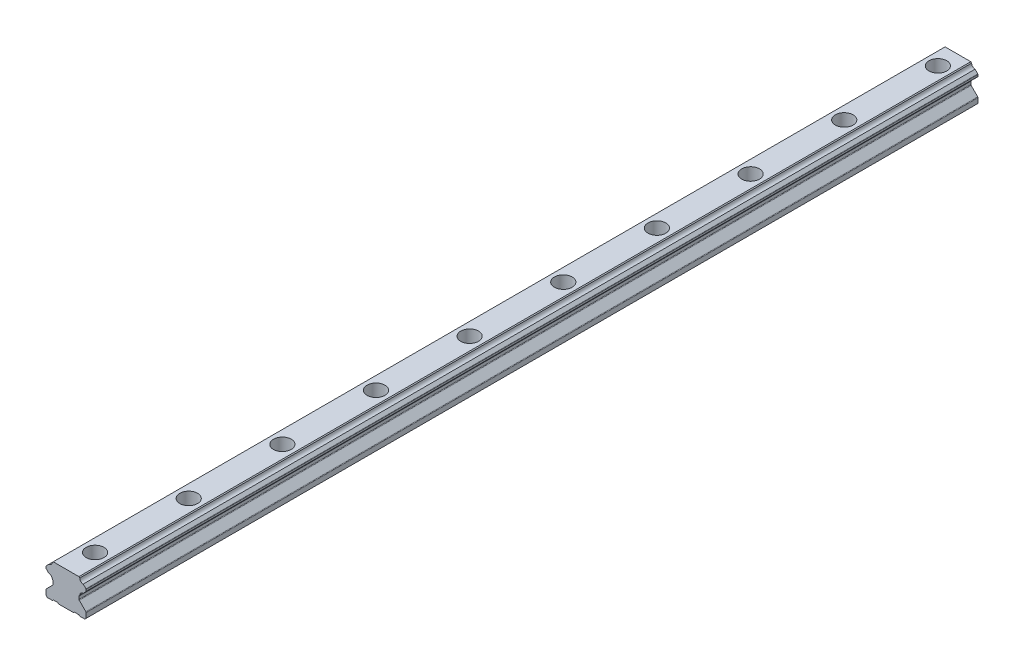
ISO-10303-21;
HEADER;
FILE_DESCRIPTION(('STEP AP214'),'2;1');
FILE_NAME('part.step','',(''),(''),'','','');
FILE_SCHEMA(('AUTOMOTIVE_DESIGN { 1 0 10303 214 1 1 1 1 }'));
ENDSEC;
DATA;
#1=APPLICATION_CONTEXT('core data for automotive mechanical design processes');
#2=APPLICATION_PROTOCOL_DEFINITION('international standard','automotive_design',2000,#1);
#3=PRODUCT_CONTEXT('',#1,'mechanical');
#4=PRODUCT('Part','Part','',(#3));
#5=PRODUCT_RELATED_PRODUCT_CATEGORY('part','',(#4));
#6=PRODUCT_DEFINITION_FORMATION('','',#4);
#7=PRODUCT_DEFINITION_CONTEXT('part definition',#1,'design');
#8=PRODUCT_DEFINITION('design','',#6,#7);
#9=PRODUCT_DEFINITION_SHAPE('','',#8);
#10=(LENGTH_UNIT() NAMED_UNIT(*) SI_UNIT(.MILLI.,.METRE.));
#11=(NAMED_UNIT(*) PLANE_ANGLE_UNIT() SI_UNIT($,.RADIAN.));
#12=(NAMED_UNIT(*) SI_UNIT($,.STERADIAN.) SOLID_ANGLE_UNIT());
#13=UNCERTAINTY_MEASURE_WITH_UNIT(LENGTH_MEASURE(1.E-05),#10,'distance_accuracy_value','');
#14=(GEOMETRIC_REPRESENTATION_CONTEXT(3) GLOBAL_UNCERTAINTY_ASSIGNED_CONTEXT((#13)) GLOBAL_UNIT_ASSIGNED_CONTEXT((#10,
#11,#12)) REPRESENTATION_CONTEXT('',''));
#15=CARTESIAN_POINT('',(0.,0.,0.));
#16=DIRECTION('',(0.,0.,1.));
#17=DIRECTION('',(1.,0.,0.));
#18=AXIS2_PLACEMENT_3D('',#15,#16,#17);
#19=CARTESIAN_POINT('',(19.5968240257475,1.34792495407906,1000.));
#20=DIRECTION('',(0.,0.,-1.));
#21=DIRECTION('',(-1.,0.,0.));
#22=AXIS2_PLACEMENT_3D('',#19,#20,#21);
#23=CYLINDRICAL_SURFACE('',#22,3.99999999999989);
#24=CARTESIAN_POINT('',(19.5968240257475,1.34792495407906,0.));
#25=DIRECTION('',(0.,0.,-1.));
#26=DIRECTION('',(1.,0.,0.));
#27=AXIS2_PLACEMENT_3D('',#24,#25,#26);
#28=CIRCLE('',#27,3.99999999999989);
#29=CARTESIAN_POINT('',(15.5980135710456,1.44546954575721,0.));
#30=VERTEX_POINT('',#29);
#31=CARTESIAN_POINT('',(19.4992794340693,5.34673540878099,0.));
#32=VERTEX_POINT('',#31);
#33=EDGE_CURVE('E350',#30,#32,#28,.T.);
#34=ORIENTED_EDGE('',*,*,#33,.T.);
#35=DIRECTION('',(0.,0.,-1.));
#36=VECTOR('',#35,1.);
#37=CARTESIAN_POINT('',(19.4992794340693,5.34673540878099,1000.));
#38=LINE('',#37,#36);
#39=CARTESIAN_POINT('',(19.4992794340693,5.34673540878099,1000.));
#40=VERTEX_POINT('',#39);
#41=EDGE_CURVE('E12',#40,#32,#38,.T.);
#42=ORIENTED_EDGE('',*,*,#41,.F.);
#43=CARTESIAN_POINT('',(19.5968240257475,1.34792495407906,1000.));
#44=DIRECTION('',(0.,0.,-1.));
#45=DIRECTION('',(1.,0.,0.));
#46=AXIS2_PLACEMENT_3D('',#43,#44,#45);
#47=CIRCLE('',#46,3.99999999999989);
#48=CARTESIAN_POINT('',(15.5980135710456,1.44546954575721,1000.));
#49=VERTEX_POINT('',#48);
#50=EDGE_CURVE('E475',#49,#40,#47,.T.);
#51=ORIENTED_EDGE('',*,*,#50,.F.);
#52=DIRECTION('',(0.,0.,-1.));
#53=VECTOR('',#52,1.);
#54=CARTESIAN_POINT('',(15.5980135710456,1.44546954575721,1000.));
#55=LINE('',#54,#53);
#56=EDGE_CURVE('E346',#49,#30,#55,.T.);
#57=ORIENTED_EDGE('',*,*,#56,.T.);
#58=EDGE_LOOP('',(#34,#42,#51,#57));
#59=FACE_BOUND('',#58,.T.);
#60=ADVANCED_FACE('F45',(#59),#23,.F.);
#61=CARTESIAN_POINT('',(19.4992794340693,5.34673540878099,1000.));
#62=DIRECTION('',(-0.707106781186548,0.707106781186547,0.));
#63=DIRECTION('',(-0.707106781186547,-0.707106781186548,0.));
#64=AXIS2_PLACEMENT_3D('',#61,#62,#63);
#65=PLANE('',#64);
#66=DIRECTION('',(0.707106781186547,0.707106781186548,0.));
#67=VECTOR('',#66,1.);
#68=CARTESIAN_POINT('',(19.4992794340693,5.34673540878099,0.));
#69=LINE('',#68,#67);
#70=CARTESIAN_POINT('',(22.5302164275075,8.37767240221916,0.));
#71=VERTEX_POINT('',#70);
#72=EDGE_CURVE('E354',#32,#71,#69,.T.);
#73=ORIENTED_EDGE('',*,*,#72,.T.);
#74=DIRECTION('',(0.,0.,-1.));
#75=VECTOR('',#74,1.);
#76=CARTESIAN_POINT('',(22.5302164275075,8.37767240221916,1000.));
#77=LINE('',#76,#75);
#78=CARTESIAN_POINT('',(22.5302164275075,8.37767240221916,1000.));
#79=VERTEX_POINT('',#78);
#80=EDGE_CURVE('E54',#79,#71,#77,.T.);
#81=ORIENTED_EDGE('',*,*,#80,.F.);
#82=DIRECTION('',(0.707106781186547,0.707106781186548,0.));
#83=VECTOR('',#82,1.);
#84=CARTESIAN_POINT('',(19.4992794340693,5.34673540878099,1000.));
#85=LINE('',#84,#83);
#86=EDGE_CURVE('E207',#40,#79,#85,.T.);
#87=ORIENTED_EDGE('',*,*,#86,.F.);
#88=ORIENTED_EDGE('',*,*,#41,.T.);
#89=EDGE_LOOP('',(#73,#81,#87,#88));
#90=FACE_BOUND('',#89,.T.);
#91=ADVANCED_FACE('F779',(#90),#65,.F.);
#92=CARTESIAN_POINT('',(21.9645310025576,8.94335782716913,1000.));
#93=DIRECTION('',(0.,0.,-1.));
#94=DIRECTION('',(-1.,0.,0.));
#95=AXIS2_PLACEMENT_3D('',#92,#93,#94);
#96=CYLINDRICAL_SURFACE('',#95,0.800000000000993);
#97=CARTESIAN_POINT('',(21.9645310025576,8.94335782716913,0.));
#98=DIRECTION('',(0.,0.,1.));
#99=DIRECTION('',(1.,0.,0.));
#100=AXIS2_PLACEMENT_3D('',#97,#98,#99);
#101=CIRCLE('',#100,0.800000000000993);
#102=CARTESIAN_POINT('',(22.7645310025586,8.94335782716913,0.));
#103=VERTEX_POINT('',#102);
#104=EDGE_CURVE('E358',#71,#103,#101,.T.);
#105=ORIENTED_EDGE('',*,*,#104,.T.);
#106=DIRECTION('',(0.,0.,-1.));
#107=VECTOR('',#106,1.);
#108=CARTESIAN_POINT('',(22.7645310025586,8.94335782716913,1000.));
#109=LINE('',#108,#107);
#110=CARTESIAN_POINT('',(22.7645310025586,8.94335782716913,1000.));
#111=VERTEX_POINT('',#110);
#112=EDGE_CURVE('E622',#111,#103,#109,.T.);
#113=ORIENTED_EDGE('',*,*,#112,.F.);
#114=CARTESIAN_POINT('',(21.9645310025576,8.94335782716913,1000.));
#115=DIRECTION('',(0.,0.,1.));
#116=DIRECTION('',(1.,0.,0.));
#117=AXIS2_PLACEMENT_3D('',#114,#115,#116);
#118=CIRCLE('',#117,0.800000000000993);
#119=EDGE_CURVE('E632',#79,#111,#118,.T.);
#120=ORIENTED_EDGE('',*,*,#119,.F.);
#121=ORIENTED_EDGE('',*,*,#80,.T.);
#122=EDGE_LOOP('',(#105,#113,#120,#121));
#123=FACE_BOUND('',#122,.T.);
#124=ADVANCED_FACE('F630',(#123),#96,.T.);
#125=CARTESIAN_POINT('',(22.7645310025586,8.94335782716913,1000.));
#126=DIRECTION('',(-1.,0.,0.));
#127=DIRECTION('',(0.,0.,1.));
#128=AXIS2_PLACEMENT_3D('',#125,#126,#127);
#129=PLANE('',#128);
#130=DIRECTION('',(0.,1.,0.));
#131=VECTOR('',#130,1.);
#132=CARTESIAN_POINT('',(22.7645310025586,8.94335782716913,0.));
#133=LINE('',#132,#131);
#134=CARTESIAN_POINT('',(22.7645310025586,10.6813431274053,0.));
#135=VERTEX_POINT('',#134);
#136=EDGE_CURVE('E361',#103,#135,#133,.T.);
#137=ORIENTED_EDGE('',*,*,#136,.T.);
#138=DIRECTION('',(0.,0.,-1.));
#139=VECTOR('',#138,1.);
#140=CARTESIAN_POINT('',(22.7645310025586,10.6813431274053,1000.));
#141=LINE('',#140,#139);
#142=CARTESIAN_POINT('',(22.7645310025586,10.6813431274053,1000.));
#143=VERTEX_POINT('',#142);
#144=EDGE_CURVE('E618',#143,#135,#141,.T.);
#145=ORIENTED_EDGE('',*,*,#144,.F.);
#146=DIRECTION('',(0.,1.,0.));
#147=VECTOR('',#146,1.);
#148=CARTESIAN_POINT('',(22.7645310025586,8.94335782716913,1000.));
#149=LINE('',#148,#147);
#150=EDGE_CURVE('E651',#111,#143,#149,.T.);
#151=ORIENTED_EDGE('',*,*,#150,.F.);
#152=ORIENTED_EDGE('',*,*,#112,.T.);
#153=EDGE_LOOP('',(#137,#145,#151,#152));
#154=FACE_BOUND('',#153,.T.);
#155=ADVANCED_FACE('F641',(#154),#129,.F.);
#156=CARTESIAN_POINT('',(21.9645310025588,10.6813430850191,1000.));
#157=DIRECTION('',(0.,0.,-1.));
#158=DIRECTION('',(-1.,0.,0.));
#159=AXIS2_PLACEMENT_3D('',#156,#157,#158);
#160=CYLINDRICAL_SURFACE('',#159,0.799999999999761);
#161=CARTESIAN_POINT('',(21.9645310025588,10.6813430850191,0.));
#162=DIRECTION('',(0.,0.,1.));
#163=DIRECTION('',(1.,0.,0.));
#164=AXIS2_PLACEMENT_3D('',#161,#162,#163);
#165=CIRCLE('',#164,0.799999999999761);
#166=CARTESIAN_POINT('',(22.5302164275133,11.2470285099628,0.));
#167=VERTEX_POINT('',#166);
#168=EDGE_CURVE('E364',#135,#167,#165,.T.);
#169=ORIENTED_EDGE('',*,*,#168,.T.);
#170=DIRECTION('',(0.,0.,-1.));
#171=VECTOR('',#170,1.);
#172=CARTESIAN_POINT('',(22.5302164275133,11.2470285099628,1000.));
#173=LINE('',#172,#171);
#174=CARTESIAN_POINT('',(22.5302164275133,11.2470285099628,1000.));
#175=VERTEX_POINT('',#174);
#176=EDGE_CURVE('E614',#175,#167,#173,.T.);
#177=ORIENTED_EDGE('',*,*,#176,.F.);
#178=CARTESIAN_POINT('',(21.9645310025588,10.6813430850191,1000.));
#179=DIRECTION('',(0.,0.,1.));
#180=DIRECTION('',(1.,0.,0.));
#181=AXIS2_PLACEMENT_3D('',#178,#179,#180);
#182=CIRCLE('',#181,0.799999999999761);
#183=EDGE_CURVE('E647',#143,#175,#182,.T.);
#184=ORIENTED_EDGE('',*,*,#183,.F.);
#185=ORIENTED_EDGE('',*,*,#144,.T.);
#186=EDGE_LOOP('',(#169,#177,#184,#185));
#187=FACE_BOUND('',#186,.T.);
#188=ADVANCED_FACE('F645',(#187),#160,.T.);
#189=CARTESIAN_POINT('',(22.5302164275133,11.2470285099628,1000.));
#190=DIRECTION('',(-0.707106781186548,-0.707106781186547,0.));
#191=DIRECTION('',(0.707106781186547,-0.707106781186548,0.));
#192=AXIS2_PLACEMENT_3D('',#189,#190,#191);
#193=PLANE('',#192);
#194=DIRECTION('',(-0.707106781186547,0.707106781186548,0.));
#195=VECTOR('',#194,1.);
#196=CARTESIAN_POINT('',(22.5302164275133,11.2470285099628,0.));
#197=LINE('',#196,#195);
#198=CARTESIAN_POINT('',(19.4982481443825,14.2789967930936,0.));
#199=VERTEX_POINT('',#198);
#200=EDGE_CURVE('E367',#167,#199,#197,.T.);
#201=ORIENTED_EDGE('',*,*,#200,.T.);
#202=DIRECTION('',(0.,0.,-1.));
#203=VECTOR('',#202,1.);
#204=CARTESIAN_POINT('',(19.4982481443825,14.2789967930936,1000.));
#205=LINE('',#204,#203);
#206=CARTESIAN_POINT('',(19.4982481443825,14.2789967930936,1000.));
#207=VERTEX_POINT('',#206);
#208=EDGE_CURVE('E610',#207,#199,#205,.T.);
#209=ORIENTED_EDGE('',*,*,#208,.F.);
#210=DIRECTION('',(-0.707106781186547,0.707106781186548,0.));
#211=VECTOR('',#210,1.);
#212=CARTESIAN_POINT('',(22.5302164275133,11.2470285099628,1000.));
#213=LINE('',#212,#211);
#214=EDGE_CURVE('E650',#175,#207,#213,.T.);
#215=ORIENTED_EDGE('',*,*,#214,.F.);
#216=ORIENTED_EDGE('',*,*,#176,.T.);
#217=EDGE_LOOP('',(#201,#209,#215,#216));
#218=FACE_BOUND('',#217,.T.);
#219=ADVANCED_FACE('F792',(#218),#193,.F.);
#220=CARTESIAN_POINT('',(19.596824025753,18.277781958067,1000.));
#221=DIRECTION('',(0.,0.,-1.));
#222=DIRECTION('',(-1.,0.,0.));
#223=AXIS2_PLACEMENT_3D('',#220,#221,#222);
#224=CYLINDRICAL_SURFACE('',#223,3.9999999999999);
#225=CARTESIAN_POINT('',(19.596824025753,18.277781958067,0.));
#226=DIRECTION('',(0.,0.,-1.));
#227=DIRECTION('',(1.,0.,0.));
#228=AXIS2_PLACEMENT_3D('',#225,#226,#227);
#229=CIRCLE('',#228,3.9999999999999);
#230=CARTESIAN_POINT('',(15.5980388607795,18.1792060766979,0.));
#231=VERTEX_POINT('',#230);
#232=EDGE_CURVE('E370',#199,#231,#229,.T.);
#233=ORIENTED_EDGE('',*,*,#232,.T.);
#234=DIRECTION('',(0.,0.,-1.));
#235=VECTOR('',#234,1.);
#236=CARTESIAN_POINT('',(15.5980388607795,18.1792060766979,1000.));
#237=LINE('',#236,#235);
#238=CARTESIAN_POINT('',(15.5980388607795,18.1792060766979,1000.));
#239=VERTEX_POINT('',#238);
#240=EDGE_CURVE('E606',#239,#231,#237,.T.);
#241=ORIENTED_EDGE('',*,*,#240,.F.);
#242=CARTESIAN_POINT('',(19.596824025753,18.277781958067,1000.));
#243=DIRECTION('',(0.,0.,-1.));
#244=DIRECTION('',(1.,0.,0.));
#245=AXIS2_PLACEMENT_3D('',#242,#243,#244);
#246=CIRCLE('',#245,3.9999999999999);
#247=EDGE_CURVE('E655',#207,#239,#246,.T.);
#248=ORIENTED_EDGE('',*,*,#247,.F.);
#249=ORIENTED_EDGE('',*,*,#208,.T.);
#250=EDGE_LOOP('',(#233,#241,#248,#249));
#251=FACE_BOUND('',#250,.T.);
#252=ADVANCED_FACE('F795',(#251),#224,.F.);
#253=CARTESIAN_POINT('',(15.5980388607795,18.1792060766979,1000.));
#254=DIRECTION('',(-0.707106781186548,-0.707106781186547,0.));
#255=DIRECTION('',(0.707106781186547,-0.707106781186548,0.));
#256=AXIS2_PLACEMENT_3D('',#253,#254,#255);
#257=PLANE('',#256);
#258=DIRECTION('',(-0.707106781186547,0.707106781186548,0.));
#259=VECTOR('',#258,1.);
#260=CARTESIAN_POINT('',(15.5980388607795,18.1792060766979,0.));
#261=LINE('',#260,#259);
#262=CARTESIAN_POINT('',(14.6648800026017,19.1123649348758,0.));
#263=VERTEX_POINT('',#262);
#264=EDGE_CURVE('E373',#231,#263,#261,.T.);
#265=ORIENTED_EDGE('',*,*,#264,.T.);
#266=DIRECTION('',(0.,0.,-1.));
#267=VECTOR('',#266,1.);
#268=CARTESIAN_POINT('',(14.6648800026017,19.1123649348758,1000.));
#269=LINE('',#268,#267);
#270=CARTESIAN_POINT('',(14.6648800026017,19.1123649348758,1000.));
#271=VERTEX_POINT('',#270);
#272=EDGE_CURVE('E602',#271,#263,#269,.T.);
#273=ORIENTED_EDGE('',*,*,#272,.F.);
#274=DIRECTION('',(-0.707106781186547,0.707106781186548,0.));
#275=VECTOR('',#274,1.);
#276=CARTESIAN_POINT('',(15.5980388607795,18.1792060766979,1000.));
#277=LINE('',#276,#275);
#278=EDGE_CURVE('E662',#239,#271,#277,.T.);
#279=ORIENTED_EDGE('',*,*,#278,.F.);
#280=ORIENTED_EDGE('',*,*,#240,.T.);
#281=EDGE_LOOP('',(#265,#273,#279,#280));
#282=FACE_BOUND('',#281,.T.);
#283=ADVANCED_FACE('F799',(#282),#257,.F.);
#284=CARTESIAN_POINT('',(14.6648800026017,19.1123649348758,1000.));
#285=DIRECTION('',(0.,-1.,0.));
#286=DIRECTION('',(0.,0.,-1.));
#287=AXIS2_PLACEMENT_3D('',#284,#285,#286);
#288=PLANE('',#287);
#289=CARTESIAN_POINT('',(0.264531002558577,19.1123649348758,127.5));
#290=DIRECTION('',(0.,1.,0.));
#291=DIRECTION('',(0.,0.,1.));
#292=AXIS2_PLACEMENT_3D('',#289,#290,#291);
#293=CIRCLE('',#292,10.);
#294=CARTESIAN_POINT('',(0.264531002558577,19.1123649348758,137.5));
#295=VERTEX_POINT('',#294);
#296=EDGE_CURVE('E1638',#295,#295,#293,.T.);
#297=ORIENTED_EDGE('',*,*,#296,.F.);
#298=EDGE_LOOP('',(#297));
#299=FACE_BOUND('',#298,.T.);
#300=CARTESIAN_POINT('',(0.264531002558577,19.1123649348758,232.499999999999));
#301=DIRECTION('',(0.,1.,0.));
#302=DIRECTION('',(0.,0.,1.));
#303=AXIS2_PLACEMENT_3D('',#300,#301,#302);
#304=CIRCLE('',#303,10.);
#305=CARTESIAN_POINT('',(0.264531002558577,19.1123649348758,242.499999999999));
#306=VERTEX_POINT('',#305);
#307=EDGE_CURVE('E1652',#306,#306,#304,.T.);
#308=ORIENTED_EDGE('',*,*,#307,.F.);
#309=EDGE_LOOP('',(#308));
#310=FACE_BOUND('',#309,.T.);
#311=CARTESIAN_POINT('',(0.264531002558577,19.1123649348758,337.499999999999));
#312=DIRECTION('',(0.,1.,0.));
#313=DIRECTION('',(0.,0.,1.));
#314=AXIS2_PLACEMENT_3D('',#311,#312,#313);
#315=CIRCLE('',#314,10.);
#316=CARTESIAN_POINT('',(0.264531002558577,19.1123649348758,347.499999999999));
#317=VERTEX_POINT('',#316);
#318=EDGE_CURVE('E1668',#317,#317,#315,.T.);
#319=ORIENTED_EDGE('',*,*,#318,.F.);
#320=EDGE_LOOP('',(#319));
#321=FACE_BOUND('',#320,.T.);
#322=CARTESIAN_POINT('',(0.264531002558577,19.1123649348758,442.499999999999));
#323=DIRECTION('',(0.,1.,0.));
#324=DIRECTION('',(0.,0.,1.));
#325=AXIS2_PLACEMENT_3D('',#322,#323,#324);
#326=CIRCLE('',#325,10.);
#327=CARTESIAN_POINT('',(0.264531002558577,19.1123649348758,452.499999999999));
#328=VERTEX_POINT('',#327);
#329=EDGE_CURVE('E1684',#328,#328,#326,.T.);
#330=ORIENTED_EDGE('',*,*,#329,.F.);
#331=EDGE_LOOP('',(#330));
#332=FACE_BOUND('',#331,.T.);
#333=CARTESIAN_POINT('',(0.264531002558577,19.1123649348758,547.499999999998));
#334=DIRECTION('',(0.,1.,0.));
#335=DIRECTION('',(0.,0.,1.));
#336=AXIS2_PLACEMENT_3D('',#333,#334,#335);
#337=CIRCLE('',#336,10.);
#338=CARTESIAN_POINT('',(0.264531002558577,19.1123649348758,557.499999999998));
#339=VERTEX_POINT('',#338);
#340=EDGE_CURVE('E1700',#339,#339,#337,.T.);
#341=ORIENTED_EDGE('',*,*,#340,.F.);
#342=EDGE_LOOP('',(#341));
#343=FACE_BOUND('',#342,.T.);
#344=CARTESIAN_POINT('',(0.264531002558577,19.1123649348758,652.499999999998));
#345=DIRECTION('',(0.,1.,0.));
#346=DIRECTION('',(0.,0.,1.));
#347=AXIS2_PLACEMENT_3D('',#344,#345,#346);
#348=CIRCLE('',#347,10.);
#349=CARTESIAN_POINT('',(0.264531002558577,19.1123649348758,662.499999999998));
#350=VERTEX_POINT('',#349);
#351=EDGE_CURVE('E1716',#350,#350,#348,.T.);
#352=ORIENTED_EDGE('',*,*,#351,.F.);
#353=EDGE_LOOP('',(#352));
#354=FACE_BOUND('',#353,.T.);
#355=CARTESIAN_POINT('',(0.264531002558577,19.1123649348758,757.499999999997));
#356=DIRECTION('',(0.,1.,0.));
#357=DIRECTION('',(0.,0.,1.));
#358=AXIS2_PLACEMENT_3D('',#355,#356,#357);
#359=CIRCLE('',#358,10.);
#360=CARTESIAN_POINT('',(0.264531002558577,19.1123649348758,767.499999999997));
#361=VERTEX_POINT('',#360);
#362=EDGE_CURVE('E1732',#361,#361,#359,.T.);
#363=ORIENTED_EDGE('',*,*,#362,.F.);
#364=EDGE_LOOP('',(#363));
#365=FACE_BOUND('',#364,.T.);
#366=CARTESIAN_POINT('',(0.264531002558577,19.1123649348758,862.499999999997));
#367=DIRECTION('',(0.,1.,0.));
#368=DIRECTION('',(0.,0.,1.));
#369=AXIS2_PLACEMENT_3D('',#366,#367,#368);
#370=CIRCLE('',#369,10.);
#371=CARTESIAN_POINT('',(0.264531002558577,19.1123649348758,872.499999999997));
#372=VERTEX_POINT('',#371);
#373=EDGE_CURVE('E1748',#372,#372,#370,.T.);
#374=ORIENTED_EDGE('',*,*,#373,.F.);
#375=EDGE_LOOP('',(#374));
#376=FACE_BOUND('',#375,.T.);
#377=CARTESIAN_POINT('',(0.264531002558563,19.1123649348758,967.499999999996));
#378=DIRECTION('',(0.,1.,0.));
#379=DIRECTION('',(0.,0.,1.));
#380=AXIS2_PLACEMENT_3D('',#377,#378,#379);
#381=CIRCLE('',#380,10.);
#382=CARTESIAN_POINT('',(0.264531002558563,19.1123649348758,977.499999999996));
#383=VERTEX_POINT('',#382);
#384=EDGE_CURVE('E1764',#383,#383,#381,.T.);
#385=ORIENTED_EDGE('',*,*,#384,.F.);
#386=EDGE_LOOP('',(#385));
#387=FACE_BOUND('',#386,.T.);
#388=CARTESIAN_POINT('',(0.26453100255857,19.1123649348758,22.5));
#389=DIRECTION('',(0.,1.,0.));
#390=DIRECTION('',(0.,0.,1.));
#391=AXIS2_PLACEMENT_3D('',#388,#389,#390);
#392=CIRCLE('',#391,10.);
#393=CARTESIAN_POINT('',(0.26453100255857,19.1123649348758,32.5));
#394=VERTEX_POINT('',#393);
#395=EDGE_CURVE('E1780',#394,#394,#392,.T.);
#396=ORIENTED_EDGE('',*,*,#395,.F.);
#397=EDGE_LOOP('',(#396));
#398=FACE_BOUND('',#397,.T.);
#399=DIRECTION('',(-1.,0.,0.));
#400=VECTOR('',#399,1.);
#401=CARTESIAN_POINT('',(14.6648800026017,19.1123649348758,0.));
#402=LINE('',#401,#400);
#403=CARTESIAN_POINT('',(-14.1358179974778,19.1123649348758,0.));
#404=VERTEX_POINT('',#403);
#405=EDGE_CURVE('E376',#263,#404,#402,.T.);
#406=ORIENTED_EDGE('',*,*,#405,.T.);
#407=DIRECTION('',(0.,0.,-1.));
#408=VECTOR('',#407,1.);
#409=CARTESIAN_POINT('',(-14.1358179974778,19.1123649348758,1000.));
#410=LINE('',#409,#408);
#411=CARTESIAN_POINT('',(-14.1358179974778,19.1123649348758,1000.));
#412=VERTEX_POINT('',#411);
#413=EDGE_CURVE('E598',#412,#404,#410,.T.);
#414=ORIENTED_EDGE('',*,*,#413,.F.);
#415=DIRECTION('',(-1.,0.,0.));
#416=VECTOR('',#415,1.);
#417=CARTESIAN_POINT('',(14.6648800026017,19.1123649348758,1000.));
#418=LINE('',#417,#416);
#419=EDGE_CURVE('E665',#271,#412,#418,.T.);
#420=ORIENTED_EDGE('',*,*,#419,.F.);
#421=ORIENTED_EDGE('',*,*,#272,.T.);
#422=EDGE_LOOP('',(#406,#414,#420,#421));
#423=FACE_BOUND('',#422,.T.);
#424=ADVANCED_FACE('F803',(#299,#310,#321,#332,#343,#354,#365,#376,#387,#398,#423),#288,.F.);
#425=CARTESIAN_POINT('',(-14.1358179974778,19.1123649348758,1000.));
#426=DIRECTION('',(0.707106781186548,-0.707106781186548,0.));
#427=DIRECTION('',(0.707106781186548,0.707106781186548,0.));
#428=AXIS2_PLACEMENT_3D('',#425,#426,#427);
#429=PLANE('',#428);
#430=DIRECTION('',(-0.707106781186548,-0.707106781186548,0.));
#431=VECTOR('',#430,1.);
#432=CARTESIAN_POINT('',(-14.1358179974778,19.1123649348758,0.));
#433=LINE('',#432,#431);
#434=CARTESIAN_POINT('',(-15.0689768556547,18.1792060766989,0.));
#435=VERTEX_POINT('',#434);
#436=EDGE_CURVE('E379',#404,#435,#433,.T.);
#437=ORIENTED_EDGE('',*,*,#436,.T.);
#438=DIRECTION('',(0.,0.,-1.));
#439=VECTOR('',#438,1.);
#440=CARTESIAN_POINT('',(-15.0689768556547,18.1792060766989,1000.));
#441=LINE('',#440,#439);
#442=CARTESIAN_POINT('',(-15.0689768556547,18.1792060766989,1000.));
#443=VERTEX_POINT('',#442);
#444=EDGE_CURVE('E594',#443,#435,#441,.T.);
#445=ORIENTED_EDGE('',*,*,#444,.F.);
#446=DIRECTION('',(-0.707106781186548,-0.707106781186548,0.));
#447=VECTOR('',#446,1.);
#448=CARTESIAN_POINT('',(-14.1358179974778,19.1123649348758,1000.));
#449=LINE('',#448,#447);
#450=EDGE_CURVE('E668',#412,#443,#449,.T.);
#451=ORIENTED_EDGE('',*,*,#450,.F.);
#452=ORIENTED_EDGE('',*,*,#413,.T.);
#453=EDGE_LOOP('',(#437,#445,#451,#452));
#454=FACE_BOUND('',#453,.T.);
#455=ADVANCED_FACE('F807',(#454),#429,.F.);
#456=CARTESIAN_POINT('',(-19.0677620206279,18.2777819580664,1000.));
#457=DIRECTION('',(0.,0.,-1.));
#458=DIRECTION('',(-1.,0.,0.));
#459=AXIS2_PLACEMENT_3D('',#456,#457,#458);
#460=CYLINDRICAL_SURFACE('',#459,3.99999999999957);
#461=CARTESIAN_POINT('',(-19.0677620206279,18.2777819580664,0.));
#462=DIRECTION('',(0.,0.,-1.));
#463=DIRECTION('',(1.,0.,0.));
#464=AXIS2_PLACEMENT_3D('',#461,#462,#463);
#465=CIRCLE('',#464,3.99999999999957);
#466=CARTESIAN_POINT('',(-18.9691861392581,14.2789967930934,0.));
#467=VERTEX_POINT('',#466);
#468=EDGE_CURVE('E382',#435,#467,#465,.T.);
#469=ORIENTED_EDGE('',*,*,#468,.T.);
#470=DIRECTION('',(0.,0.,-1.));
#471=VECTOR('',#470,1.);
#472=CARTESIAN_POINT('',(-18.9691861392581,14.2789967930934,1000.));
#473=LINE('',#472,#471);
#474=CARTESIAN_POINT('',(-18.9691861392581,14.2789967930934,1000.));
#475=VERTEX_POINT('',#474);
#476=EDGE_CURVE('E590',#475,#467,#473,.T.);
#477=ORIENTED_EDGE('',*,*,#476,.F.);
#478=CARTESIAN_POINT('',(-19.0677620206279,18.2777819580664,1000.));
#479=DIRECTION('',(0.,0.,-1.));
#480=DIRECTION('',(1.,0.,0.));
#481=AXIS2_PLACEMENT_3D('',#478,#479,#480);
#482=CIRCLE('',#481,3.99999999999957);
#483=EDGE_CURVE('E671',#443,#475,#482,.T.);
#484=ORIENTED_EDGE('',*,*,#483,.F.);
#485=ORIENTED_EDGE('',*,*,#444,.T.);
#486=EDGE_LOOP('',(#469,#477,#484,#485));
#487=FACE_BOUND('',#486,.T.);
#488=ADVANCED_FACE('F811',(#487),#460,.F.);
#489=CARTESIAN_POINT('',(-18.9691861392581,14.2789967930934,1000.));
#490=DIRECTION('',(0.707106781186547,-0.707106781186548,0.));
#491=DIRECTION('',(0.707106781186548,0.707106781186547,0.));
#492=AXIS2_PLACEMENT_3D('',#489,#490,#491);
#493=PLANE('',#492);
#494=DIRECTION('',(-0.707106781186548,-0.707106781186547,0.));
#495=VECTOR('',#494,1.);
#496=CARTESIAN_POINT('',(-18.9691861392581,14.2789967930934,0.));
#497=LINE('',#496,#495);
#498=CARTESIAN_POINT('',(-22.0011544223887,11.2470285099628,0.));
#499=VERTEX_POINT('',#498);
#500=EDGE_CURVE('E385',#467,#499,#497,.T.);
#501=ORIENTED_EDGE('',*,*,#500,.T.);
#502=DIRECTION('',(0.,0.,-1.));
#503=VECTOR('',#502,1.);
#504=CARTESIAN_POINT('',(-22.0011544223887,11.2470285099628,1000.));
#505=LINE('',#504,#503);
#506=CARTESIAN_POINT('',(-22.0011544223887,11.2470285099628,1000.));
#507=VERTEX_POINT('',#506);
#508=EDGE_CURVE('E586',#507,#499,#505,.T.);
#509=ORIENTED_EDGE('',*,*,#508,.F.);
#510=DIRECTION('',(-0.707106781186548,-0.707106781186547,0.));
#511=VECTOR('',#510,1.);
#512=CARTESIAN_POINT('',(-18.9691861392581,14.2789967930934,1000.));
#513=LINE('',#512,#511);
#514=EDGE_CURVE('E674',#475,#507,#513,.T.);
#515=ORIENTED_EDGE('',*,*,#514,.F.);
#516=ORIENTED_EDGE('',*,*,#476,.T.);
#517=EDGE_LOOP('',(#501,#509,#515,#516));
#518=FACE_BOUND('',#517,.T.);
#519=ADVANCED_FACE('F815',(#518),#493,.F.);
#520=CARTESIAN_POINT('',(-21.4354689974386,10.681343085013,1000.));
#521=DIRECTION('',(0.,0.,-1.));
#522=DIRECTION('',(-1.,0.,0.));
#523=AXIS2_PLACEMENT_3D('',#520,#521,#522);
#524=CYLINDRICAL_SURFACE('',#523,0.800000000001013);
#525=CARTESIAN_POINT('',(-21.4354689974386,10.681343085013,0.));
#526=DIRECTION('',(0.,0.,1.));
#527=DIRECTION('',(1.,0.,0.));
#528=AXIS2_PLACEMENT_3D('',#525,#526,#527);
#529=CIRCLE('',#528,0.800000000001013);
#530=CARTESIAN_POINT('',(-22.2354689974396,10.6813430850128,0.));
#531=VERTEX_POINT('',#530);
#532=EDGE_CURVE('E388',#499,#531,#529,.T.);
#533=ORIENTED_EDGE('',*,*,#532,.T.);
#534=DIRECTION('',(0.,0.,-1.));
#535=VECTOR('',#534,1.);
#536=CARTESIAN_POINT('',(-22.2354689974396,10.6813430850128,1000.));
#537=LINE('',#536,#535);
#538=CARTESIAN_POINT('',(-22.2354689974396,10.6813430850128,1000.));
#539=VERTEX_POINT('',#538);
#540=EDGE_CURVE('E582',#539,#531,#537,.T.);
#541=ORIENTED_EDGE('',*,*,#540,.F.);
#542=CARTESIAN_POINT('',(-21.4354689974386,10.681343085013,1000.));
#543=DIRECTION('',(0.,0.,1.));
#544=DIRECTION('',(1.,0.,0.));
#545=AXIS2_PLACEMENT_3D('',#542,#543,#544);
#546=CIRCLE('',#545,0.800000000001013);
#547=EDGE_CURVE('E677',#507,#539,#546,.T.);
#548=ORIENTED_EDGE('',*,*,#547,.F.);
#549=ORIENTED_EDGE('',*,*,#508,.T.);
#550=EDGE_LOOP('',(#533,#541,#548,#549));
#551=FACE_BOUND('',#550,.T.);
#552=ADVANCED_FACE('F819',(#551),#524,.T.);
#553=CARTESIAN_POINT('',(-22.2354689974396,10.6813430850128,1000.));
#554=DIRECTION('',(1.,0.,0.));
#555=DIRECTION('',(0.,0.,-1.));
#556=AXIS2_PLACEMENT_3D('',#553,#554,#555);
#557=PLANE('',#556);
#558=DIRECTION('',(0.,-1.,0.));
#559=VECTOR('',#558,1.);
#560=CARTESIAN_POINT('',(-22.2354689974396,10.6813430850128,0.));
#561=LINE('',#560,#559);
#562=CARTESIAN_POINT('',(-22.2354689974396,8.94335778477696,0.));
#563=VERTEX_POINT('',#562);
#564=EDGE_CURVE('E391',#531,#563,#561,.T.);
#565=ORIENTED_EDGE('',*,*,#564,.T.);
#566=DIRECTION('',(0.,0.,-1.));
#567=VECTOR('',#566,1.);
#568=CARTESIAN_POINT('',(-22.2354689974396,8.94335778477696,1000.));
#569=LINE('',#568,#567);
#570=CARTESIAN_POINT('',(-22.2354689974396,8.94335778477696,1000.));
#571=VERTEX_POINT('',#570);
#572=EDGE_CURVE('E578',#571,#563,#569,.T.);
#573=ORIENTED_EDGE('',*,*,#572,.F.);
#574=DIRECTION('',(0.,-1.,0.));
#575=VECTOR('',#574,1.);
#576=CARTESIAN_POINT('',(-22.2354689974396,10.6813430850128,1000.));
#577=LINE('',#576,#575);
#578=EDGE_CURVE('E680',#539,#571,#577,.T.);
#579=ORIENTED_EDGE('',*,*,#578,.F.);
#580=ORIENTED_EDGE('',*,*,#540,.T.);
#581=EDGE_LOOP('',(#565,#573,#579,#580));
#582=FACE_BOUND('',#581,.T.);
#583=ADVANCED_FACE('F823',(#582),#557,.F.);
#584=CARTESIAN_POINT('',(-21.4354689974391,8.94335778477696,1000.));
#585=DIRECTION('',(0.,0.,-1.));
#586=DIRECTION('',(-1.,0.,0.));
#587=AXIS2_PLACEMENT_3D('',#584,#585,#586);
#588=CYLINDRICAL_SURFACE('',#587,0.800000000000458);
#589=CARTESIAN_POINT('',(-21.4354689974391,8.94335778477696,0.));
#590=DIRECTION('',(0.,0.,1.));
#591=DIRECTION('',(1.,0.,0.));
#592=AXIS2_PLACEMENT_3D('',#589,#590,#591);
#593=CIRCLE('',#592,0.800000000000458);
#594=CARTESIAN_POINT('',(-22.0011544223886,8.37767235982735,0.));
#595=VERTEX_POINT('',#594);
#596=EDGE_CURVE('E394',#563,#595,#593,.T.);
#597=ORIENTED_EDGE('',*,*,#596,.T.);
#598=DIRECTION('',(0.,0.,-1.));
#599=VECTOR('',#598,1.);
#600=CARTESIAN_POINT('',(-22.0011544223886,8.37767235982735,1000.));
#601=LINE('',#600,#599);
#602=CARTESIAN_POINT('',(-22.0011544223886,8.37767235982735,1000.));
#603=VERTEX_POINT('',#602);
#604=EDGE_CURVE('E574',#603,#595,#601,.T.);
#605=ORIENTED_EDGE('',*,*,#604,.F.);
#606=CARTESIAN_POINT('',(-21.4354689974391,8.94335778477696,1000.));
#607=DIRECTION('',(0.,0.,1.));
#608=DIRECTION('',(1.,0.,0.));
#609=AXIS2_PLACEMENT_3D('',#606,#607,#608);
#610=CIRCLE('',#609,0.800000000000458);
#611=EDGE_CURVE('E683',#571,#603,#610,.T.);
#612=ORIENTED_EDGE('',*,*,#611,.F.);
#613=ORIENTED_EDGE('',*,*,#572,.T.);
#614=EDGE_LOOP('',(#597,#605,#612,#613));
#615=FACE_BOUND('',#614,.T.);
#616=ADVANCED_FACE('F827',(#615),#588,.T.);
#617=CARTESIAN_POINT('',(-22.0011544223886,8.37767235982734,1000.));
#618=DIRECTION('',(0.707106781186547,0.707106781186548,0.));
#619=DIRECTION('',(-0.707106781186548,0.707106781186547,0.));
#620=AXIS2_PLACEMENT_3D('',#617,#618,#619);
#621=PLANE('',#620);
#622=DIRECTION('',(0.707106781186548,-0.707106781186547,0.));
#623=VECTOR('',#622,1.);
#624=CARTESIAN_POINT('',(-22.0011544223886,8.37767235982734,0.));
#625=LINE('',#624,#623);
#626=CARTESIAN_POINT('',(-18.9702174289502,5.34673536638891,0.));
#627=VERTEX_POINT('',#626);
#628=EDGE_CURVE('E397',#595,#627,#625,.T.);
#629=ORIENTED_EDGE('',*,*,#628,.T.);
#630=DIRECTION('',(0.,0.,-1.));
#631=VECTOR('',#630,1.);
#632=CARTESIAN_POINT('',(-18.9702174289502,5.34673536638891,1000.));
#633=LINE('',#632,#631);
#634=CARTESIAN_POINT('',(-18.9702174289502,5.34673536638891,1000.));
#635=VERTEX_POINT('',#634);
#636=EDGE_CURVE('E570',#635,#627,#633,.T.);
#637=ORIENTED_EDGE('',*,*,#636,.F.);
#638=DIRECTION('',(0.707106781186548,-0.707106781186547,0.));
#639=VECTOR('',#638,1.);
#640=CARTESIAN_POINT('',(-22.0011544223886,8.37767235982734,1000.));
#641=LINE('',#640,#639);
#642=EDGE_CURVE('E686',#603,#635,#641,.T.);
#643=ORIENTED_EDGE('',*,*,#642,.F.);
#644=ORIENTED_EDGE('',*,*,#604,.T.);
#645=EDGE_LOOP('',(#629,#637,#643,#644));
#646=FACE_BOUND('',#645,.T.);
#647=ADVANCED_FACE('F831',(#646),#621,.F.);
#648=CARTESIAN_POINT('',(-19.0677620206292,1.34792491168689,1000.));
#649=DIRECTION('',(0.,0.,-1.));
#650=DIRECTION('',(-1.,0.,0.));
#651=AXIS2_PLACEMENT_3D('',#648,#649,#650);
#652=CYLINDRICAL_SURFACE('',#651,4.00000000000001);
#653=CARTESIAN_POINT('',(-19.0677620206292,1.34792491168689,0.));
#654=DIRECTION('',(0.,0.,-1.));
#655=DIRECTION('',(1.,0.,0.));
#656=AXIS2_PLACEMENT_3D('',#653,#654,#655);
#657=CIRCLE('',#656,4.00000000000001);
#658=CARTESIAN_POINT('',(-15.0689515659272,1.44546950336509,0.));
#659=VERTEX_POINT('',#658);
#660=EDGE_CURVE('E400',#627,#659,#657,.T.);
#661=ORIENTED_EDGE('',*,*,#660,.T.);
#662=DIRECTION('',(0.,0.,-1.));
#663=VECTOR('',#662,1.);
#664=CARTESIAN_POINT('',(-15.0689515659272,1.44546950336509,1000.));
#665=LINE('',#664,#663);
#666=CARTESIAN_POINT('',(-15.0689515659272,1.44546950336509,1000.));
#667=VERTEX_POINT('',#666);
#668=EDGE_CURVE('E566',#667,#659,#665,.T.);
#669=ORIENTED_EDGE('',*,*,#668,.F.);
#670=CARTESIAN_POINT('',(-19.0677620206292,1.34792491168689,1000.));
#671=DIRECTION('',(0.,0.,-1.));
#672=DIRECTION('',(1.,0.,0.));
#673=AXIS2_PLACEMENT_3D('',#670,#671,#672);
#674=CIRCLE('',#673,4.00000000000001);
#675=EDGE_CURVE('E689',#635,#667,#674,.T.);
#676=ORIENTED_EDGE('',*,*,#675,.F.);
#677=ORIENTED_EDGE('',*,*,#636,.T.);
#678=EDGE_LOOP('',(#661,#669,#676,#677));
#679=FACE_BOUND('',#678,.T.);
#680=ADVANCED_FACE('F835',(#679),#652,.F.);
#681=CARTESIAN_POINT('',(-15.0689515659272,1.44546950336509,1000.));
#682=DIRECTION('',(0.707106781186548,0.707106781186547,0.));
#683=DIRECTION('',(-0.707106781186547,0.707106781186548,0.));
#684=AXIS2_PLACEMENT_3D('',#681,#682,#683);
#685=PLANE('',#684);
#686=DIRECTION('',(0.707106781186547,-0.707106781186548,0.));
#687=VECTOR('',#686,1.);
#688=CARTESIAN_POINT('',(-15.0689515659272,1.44546950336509,0.));
#689=LINE('',#688,#687);
#690=CARTESIAN_POINT('',(-14.5869408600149,0.963458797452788,0.));
#691=VERTEX_POINT('',#690);
#692=EDGE_CURVE('E403',#659,#691,#689,.T.);
#693=ORIENTED_EDGE('',*,*,#692,.T.);
#694=DIRECTION('',(0.,0.,-1.));
#695=VECTOR('',#694,1.);
#696=CARTESIAN_POINT('',(-14.5869408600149,0.963458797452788,1000.));
#697=LINE('',#696,#695);
#698=CARTESIAN_POINT('',(-14.5869408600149,0.963458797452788,1000.));
#699=VERTEX_POINT('',#698);
#700=EDGE_CURVE('E562',#699,#691,#697,.T.);
#701=ORIENTED_EDGE('',*,*,#700,.F.);
#702=DIRECTION('',(0.707106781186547,-0.707106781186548,0.));
#703=VECTOR('',#702,1.);
#704=CARTESIAN_POINT('',(-15.0689515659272,1.44546950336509,1000.));
#705=LINE('',#704,#703);
#706=EDGE_CURVE('E692',#667,#699,#705,.T.);
#707=ORIENTED_EDGE('',*,*,#706,.F.);
#708=ORIENTED_EDGE('',*,*,#668,.T.);
#709=EDGE_LOOP('',(#693,#701,#707,#708));
#710=FACE_BOUND('',#709,.T.);
#711=ADVANCED_FACE('F839',(#710),#685,.F.);
#712=CARTESIAN_POINT('',(-15.4354689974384,0.114930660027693,1000.));
#713=DIRECTION('',(0.,0.,-1.));
#714=DIRECTION('',(-1.,0.,0.));
#715=AXIS2_PLACEMENT_3D('',#712,#713,#714);
#716=CYLINDRICAL_SURFACE('',#715,1.20000000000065);
#717=CARTESIAN_POINT('',(-15.4354689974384,0.114930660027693,0.));
#718=DIRECTION('',(0.,0.,-1.));
#719=DIRECTION('',(1.,0.,0.));
#720=AXIS2_PLACEMENT_3D('',#717,#718,#719);
#721=CIRCLE('',#720,1.20000000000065);
#722=CARTESIAN_POINT('',(-14.2354689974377,0.114930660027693,0.));
#723=VERTEX_POINT('',#722);
#724=EDGE_CURVE('E406',#691,#723,#721,.T.);
#725=ORIENTED_EDGE('',*,*,#724,.T.);
#726=DIRECTION('',(0.,0.,-1.));
#727=VECTOR('',#726,1.);
#728=CARTESIAN_POINT('',(-14.2354689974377,0.114930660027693,1000.));
#729=LINE('',#728,#727);
#730=CARTESIAN_POINT('',(-14.2354689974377,0.114930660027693,1000.));
#731=VERTEX_POINT('',#730);
#732=EDGE_CURVE('E558',#731,#723,#729,.T.);
#733=ORIENTED_EDGE('',*,*,#732,.F.);
#734=CARTESIAN_POINT('',(-15.4354689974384,0.114930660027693,1000.));
#735=DIRECTION('',(0.,0.,-1.));
#736=DIRECTION('',(1.,0.,0.));
#737=AXIS2_PLACEMENT_3D('',#734,#735,#736);
#738=CIRCLE('',#737,1.20000000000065);
#739=EDGE_CURVE('E695',#699,#731,#738,.T.);
#740=ORIENTED_EDGE('',*,*,#739,.F.);
#741=ORIENTED_EDGE('',*,*,#700,.T.);
#742=EDGE_LOOP('',(#725,#733,#740,#741));
#743=FACE_BOUND('',#742,.T.);
#744=ADVANCED_FACE('F843',(#743),#716,.F.);
#745=CARTESIAN_POINT('',(-14.2354689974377,0.114930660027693,1000.));
#746=DIRECTION('',(1.,0.,0.));
#747=DIRECTION('',(0.,0.,-1.));
#748=AXIS2_PLACEMENT_3D('',#745,#746,#747);
#749=PLANE('',#748);
#750=DIRECTION('',(0.,-1.,0.));
#751=VECTOR('',#750,1.);
#752=CARTESIAN_POINT('',(-14.2354689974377,0.114930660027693,0.));
#753=LINE('',#752,#751);
#754=CARTESIAN_POINT('',(-14.2354689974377,-2.89025219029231,0.));
#755=VERTEX_POINT('',#754);
#756=EDGE_CURVE('E409',#723,#755,#753,.T.);
#757=ORIENTED_EDGE('',*,*,#756,.T.);
#758=DIRECTION('',(0.,0.,-1.));
#759=VECTOR('',#758,1.);
#760=CARTESIAN_POINT('',(-14.2354689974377,-2.89025219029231,1000.));
#761=LINE('',#760,#759);
#762=CARTESIAN_POINT('',(-14.2354689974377,-2.89025219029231,1000.));
#763=VERTEX_POINT('',#762);
#764=EDGE_CURVE('E554',#763,#755,#761,.T.);
#765=ORIENTED_EDGE('',*,*,#764,.F.);
#766=DIRECTION('',(0.,-1.,0.));
#767=VECTOR('',#766,1.);
#768=CARTESIAN_POINT('',(-14.2354689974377,0.114930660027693,1000.));
#769=LINE('',#768,#767);
#770=EDGE_CURVE('E698',#731,#763,#769,.T.);
#771=ORIENTED_EDGE('',*,*,#770,.F.);
#772=ORIENTED_EDGE('',*,*,#732,.T.);
#773=EDGE_LOOP('',(#757,#765,#771,#772));
#774=FACE_BOUND('',#773,.T.);
#775=ADVANCED_FACE('F847',(#774),#749,.F.);
#776=CARTESIAN_POINT('',(-15.4354689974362,-2.89025219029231,1000.));
#777=DIRECTION('',(0.,0.,-1.));
#778=DIRECTION('',(-1.,0.,0.));
#779=AXIS2_PLACEMENT_3D('',#776,#777,#778);
#780=CYLINDRICAL_SURFACE('',#779,1.19999999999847);
#781=CARTESIAN_POINT('',(-15.4354689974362,-2.89025219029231,0.));
#782=DIRECTION('',(0.,0.,-1.));
#783=DIRECTION('',(1.,0.,0.));
#784=AXIS2_PLACEMENT_3D('',#781,#782,#783);
#785=CIRCLE('',#784,1.19999999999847);
#786=CARTESIAN_POINT('',(-14.5869408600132,-3.73878032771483,0.));
#787=VERTEX_POINT('',#786);
#788=EDGE_CURVE('E412',#755,#787,#785,.T.);
#789=ORIENTED_EDGE('',*,*,#788,.T.);
#790=DIRECTION('',(0.,0.,-1.));
#791=VECTOR('',#790,1.);
#792=CARTESIAN_POINT('',(-14.5869408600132,-3.73878032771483,1000.));
#793=LINE('',#792,#791);
#794=CARTESIAN_POINT('',(-14.5869408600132,-3.73878032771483,1000.));
#795=VERTEX_POINT('',#794);
#796=EDGE_CURVE('E550',#795,#787,#793,.T.);
#797=ORIENTED_EDGE('',*,*,#796,.F.);
#798=CARTESIAN_POINT('',(-15.4354689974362,-2.89025219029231,1000.));
#799=DIRECTION('',(0.,0.,-1.));
#800=DIRECTION('',(1.,0.,0.));
#801=AXIS2_PLACEMENT_3D('',#798,#799,#800);
#802=CIRCLE('',#801,1.19999999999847);
#803=EDGE_CURVE('E701',#763,#795,#802,.T.);
#804=ORIENTED_EDGE('',*,*,#803,.F.);
#805=ORIENTED_EDGE('',*,*,#764,.T.);
#806=EDGE_LOOP('',(#789,#797,#804,#805));
#807=FACE_BOUND('',#806,.T.);
#808=ADVANCED_FACE('F851',(#807),#780,.F.);
#809=CARTESIAN_POINT('',(-14.5869408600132,-3.73878032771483,1000.));
#810=DIRECTION('',(0.707106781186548,-0.707106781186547,0.));
#811=DIRECTION('',(0.707106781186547,0.707106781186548,0.));
#812=AXIS2_PLACEMENT_3D('',#809,#810,#811);
#813=PLANE('',#812);
#814=DIRECTION('',(-0.707106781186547,-0.707106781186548,0.));
#815=VECTOR('',#814,1.);
#816=CARTESIAN_POINT('',(-14.5869408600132,-3.73878032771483,0.));
#817=LINE('',#816,#815);
#818=CARTESIAN_POINT('',(-21.8839971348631,-11.0358366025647,0.));
#819=VERTEX_POINT('',#818);
#820=EDGE_CURVE('E415',#787,#819,#817,.T.);
#821=ORIENTED_EDGE('',*,*,#820,.T.);
#822=DIRECTION('',(0.,0.,-1.));
#823=VECTOR('',#822,1.);
#824=CARTESIAN_POINT('',(-21.8839971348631,-11.0358366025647,1000.));
#825=LINE('',#824,#823);
#826=CARTESIAN_POINT('',(-21.8839971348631,-11.0358366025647,1000.));
#827=VERTEX_POINT('',#826);
#828=EDGE_CURVE('E546',#827,#819,#825,.T.);
#829=ORIENTED_EDGE('',*,*,#828,.F.);
#830=DIRECTION('',(-0.707106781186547,-0.707106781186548,0.));
#831=VECTOR('',#830,1.);
#832=CARTESIAN_POINT('',(-14.5869408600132,-3.73878032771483,1000.));
#833=LINE('',#832,#831);
#834=EDGE_CURVE('E704',#795,#827,#833,.T.);
#835=ORIENTED_EDGE('',*,*,#834,.F.);
#836=ORIENTED_EDGE('',*,*,#796,.T.);
#837=EDGE_LOOP('',(#821,#829,#835,#836));
#838=FACE_BOUND('',#837,.T.);
#839=ADVANCED_FACE('F855',(#838),#813,.F.);
#840=CARTESIAN_POINT('',(-21.0354689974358,-11.8843647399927,1000.));
#841=DIRECTION('',(0.,0.,-1.));
#842=DIRECTION('',(-1.,0.,0.));
#843=AXIS2_PLACEMENT_3D('',#840,#841,#842);
#844=CYLINDRICAL_SURFACE('',#843,1.20000000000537);
#845=CARTESIAN_POINT('',(-21.0354689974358,-11.8843647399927,0.));
#846=DIRECTION('',(0.,0.,1.));
#847=DIRECTION('',(1.,0.,0.));
#848=AXIS2_PLACEMENT_3D('',#845,#846,#847);
#849=CIRCLE('',#848,1.20000000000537);
#850=CARTESIAN_POINT('',(-22.2354689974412,-11.8843647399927,0.));
#851=VERTEX_POINT('',#850);
#852=EDGE_CURVE('E418',#819,#851,#849,.T.);
#853=ORIENTED_EDGE('',*,*,#852,.T.);
#854=DIRECTION('',(0.,0.,-1.));
#855=VECTOR('',#854,1.);
#856=CARTESIAN_POINT('',(-22.2354689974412,-11.8843647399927,1000.));
#857=LINE('',#856,#855);
#858=CARTESIAN_POINT('',(-22.2354689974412,-11.8843647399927,1000.));
#859=VERTEX_POINT('',#858);
#860=EDGE_CURVE('E542',#859,#851,#857,.T.);
#861=ORIENTED_EDGE('',*,*,#860,.F.);
#862=CARTESIAN_POINT('',(-21.0354689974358,-11.8843647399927,1000.));
#863=DIRECTION('',(0.,0.,1.));
#864=DIRECTION('',(1.,0.,0.));
#865=AXIS2_PLACEMENT_3D('',#862,#863,#864);
#866=CIRCLE('',#865,1.20000000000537);
#867=EDGE_CURVE('E707',#827,#859,#866,.T.);
#868=ORIENTED_EDGE('',*,*,#867,.F.);
#869=ORIENTED_EDGE('',*,*,#828,.T.);
#870=EDGE_LOOP('',(#853,#861,#868,#869));
#871=FACE_BOUND('',#870,.T.);
#872=ADVANCED_FACE('F859',(#871),#844,.T.);
#873=CARTESIAN_POINT('',(-22.2354689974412,-11.8843647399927,1000.));
#874=DIRECTION('',(1.,0.,0.));
#875=DIRECTION('',(0.,0.,-1.));
#876=AXIS2_PLACEMENT_3D('',#873,#874,#875);
#877=PLANE('',#876);
#878=DIRECTION('',(0.,-1.,0.));
#879=VECTOR('',#878,1.);
#880=CARTESIAN_POINT('',(-22.2354689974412,-11.8843647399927,0.));
#881=LINE('',#880,#879);
#882=CARTESIAN_POINT('',(-22.2354689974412,-17.3876350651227,0.));
#883=VERTEX_POINT('',#882);
#884=EDGE_CURVE('E421',#851,#883,#881,.T.);
#885=ORIENTED_EDGE('',*,*,#884,.T.);
#886=DIRECTION('',(0.,0.,-1.));
#887=VECTOR('',#886,1.);
#888=CARTESIAN_POINT('',(-22.2354689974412,-17.3876350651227,1000.));
#889=LINE('',#888,#887);
#890=CARTESIAN_POINT('',(-22.2354689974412,-17.3876350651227,1000.));
#891=VERTEX_POINT('',#890);
#892=EDGE_CURVE('E538',#891,#883,#889,.T.);
#893=ORIENTED_EDGE('',*,*,#892,.F.);
#894=DIRECTION('',(0.,-1.,0.));
#895=VECTOR('',#894,1.);
#896=CARTESIAN_POINT('',(-22.2354689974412,-11.8843647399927,1000.));
#897=LINE('',#896,#895);
#898=EDGE_CURVE('E710',#859,#891,#897,.T.);
#899=ORIENTED_EDGE('',*,*,#898,.F.);
#900=ORIENTED_EDGE('',*,*,#860,.T.);
#901=EDGE_LOOP('',(#885,#893,#899,#900));
#902=FACE_BOUND('',#901,.T.);
#903=ADVANCED_FACE('F863',(#902),#877,.F.);
#904=CARTESIAN_POINT('',(-22.2354689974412,-17.3876350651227,1000.));
#905=DIRECTION('',(0.707106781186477,0.707106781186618,0.));
#906=DIRECTION('',(-0.707106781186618,0.707106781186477,0.));
#907=AXIS2_PLACEMENT_3D('',#904,#905,#906);
#908=PLANE('',#907);
#909=DIRECTION('',(0.707106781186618,-0.707106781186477,0.));
#910=VECTOR('',#909,1.);
#911=CARTESIAN_POINT('',(-22.2354689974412,-17.3876350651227,0.));
#912=LINE('',#911,#910);
#913=CARTESIAN_POINT('',(-20.7354689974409,-18.8876350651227,0.));
#914=VERTEX_POINT('',#913);
#915=EDGE_CURVE('E424',#883,#914,#912,.T.);
#916=ORIENTED_EDGE('',*,*,#915,.T.);
#917=DIRECTION('',(0.,0.,-1.));
#918=VECTOR('',#917,1.);
#919=CARTESIAN_POINT('',(-20.7354689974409,-18.8876350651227,1000.));
#920=LINE('',#919,#918);
#921=CARTESIAN_POINT('',(-20.7354689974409,-18.8876350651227,1000.));
#922=VERTEX_POINT('',#921);
#923=EDGE_CURVE('E534',#922,#914,#920,.T.);
#924=ORIENTED_EDGE('',*,*,#923,.F.);
#925=DIRECTION('',(0.707106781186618,-0.707106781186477,0.));
#926=VECTOR('',#925,1.);
#927=CARTESIAN_POINT('',(-22.2354689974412,-17.3876350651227,1000.));
#928=LINE('',#927,#926);
#929=EDGE_CURVE('E713',#891,#922,#928,.T.);
#930=ORIENTED_EDGE('',*,*,#929,.F.);
#931=ORIENTED_EDGE('',*,*,#892,.T.);
#932=EDGE_LOOP('',(#916,#924,#930,#931));
#933=FACE_BOUND('',#932,.T.);
#934=ADVANCED_FACE('F867',(#933),#908,.F.);
#935=CARTESIAN_POINT('',(-20.7354689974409,-18.8876350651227,1000.));
#936=DIRECTION('',(0.,1.,0.));
#937=DIRECTION('',(0.,0.,1.));
#938=AXIS2_PLACEMENT_3D('',#935,#936,#937);
#939=PLANE('',#938);
#940=DIRECTION('',(1.,0.,0.));
#941=VECTOR('',#940,1.);
#942=CARTESIAN_POINT('',(-20.7354689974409,-18.8876350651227,0.));
#943=LINE('',#942,#941);
#944=CARTESIAN_POINT('',(-14.9858433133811,-18.8876350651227,0.));
#945=VERTEX_POINT('',#944);
#946=EDGE_CURVE('E427',#914,#945,#943,.T.);
#947=ORIENTED_EDGE('',*,*,#946,.T.);
#948=DIRECTION('',(0.,0.,-1.));
#949=VECTOR('',#948,1.);
#950=CARTESIAN_POINT('',(-14.9858433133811,-18.8876350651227,1000.));
#951=LINE('',#950,#949);
#952=CARTESIAN_POINT('',(-14.9858433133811,-18.8876350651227,1000.));
#953=VERTEX_POINT('',#952);
#954=EDGE_CURVE('E530',#953,#945,#951,.T.);
#955=ORIENTED_EDGE('',*,*,#954,.F.);
#956=DIRECTION('',(1.,0.,0.));
#957=VECTOR('',#956,1.);
#958=CARTESIAN_POINT('',(-20.7354689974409,-18.8876350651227,1000.));
#959=LINE('',#958,#957);
#960=EDGE_CURVE('E716',#922,#953,#959,.T.);
#961=ORIENTED_EDGE('',*,*,#960,.F.);
#962=ORIENTED_EDGE('',*,*,#923,.T.);
#963=EDGE_LOOP('',(#947,#955,#961,#962));
#964=FACE_BOUND('',#963,.T.);
#965=ADVANCED_FACE('F871',(#964),#939,.F.);
#966=CARTESIAN_POINT('',(-14.9858433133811,-18.8876350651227,1000.));
#967=DIRECTION('',(-0.707106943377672,0.707106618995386,0.));
#968=DIRECTION('',(-0.707106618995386,-0.707106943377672,0.));
#969=AXIS2_PLACEMENT_3D('',#966,#967,#968);
#970=PLANE('',#969);
#971=DIRECTION('',(0.707106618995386,0.707106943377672,0.));
#972=VECTOR('',#971,1.);
#973=CARTESIAN_POINT('',(-14.9858433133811,-18.8876350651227,0.));
#974=LINE('',#973,#972);
#975=CARTESIAN_POINT('',(-13.9858437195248,-17.8876350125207,0.));
#976=VERTEX_POINT('',#975);
#977=EDGE_CURVE('E430',#945,#976,#974,.T.);
#978=ORIENTED_EDGE('',*,*,#977,.T.);
#979=DIRECTION('',(0.,0.,-1.));
#980=VECTOR('',#979,1.);
#981=CARTESIAN_POINT('',(-13.9858437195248,-17.8876350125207,1000.));
#982=LINE('',#981,#980);
#983=CARTESIAN_POINT('',(-13.9858437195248,-17.8876350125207,1000.));
#984=VERTEX_POINT('',#983);
#985=EDGE_CURVE('E526',#984,#976,#982,.T.);
#986=ORIENTED_EDGE('',*,*,#985,.F.);
#987=DIRECTION('',(0.707106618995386,0.707106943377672,0.));
#988=VECTOR('',#987,1.);
#989=CARTESIAN_POINT('',(-14.9858433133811,-18.8876350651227,1000.));
#990=LINE('',#989,#988);
#991=EDGE_CURVE('E719',#953,#984,#990,.T.);
#992=ORIENTED_EDGE('',*,*,#991,.F.);
#993=ORIENTED_EDGE('',*,*,#954,.T.);
#994=EDGE_LOOP('',(#978,#986,#992,#993));
#995=FACE_BOUND('',#994,.T.);
#996=ADVANCED_FACE('F875',(#995),#970,.F.);
#997=CARTESIAN_POINT('',(-13.9858437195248,-17.8876350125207,1000.));
#998=DIRECTION('',(0.,1.,0.));
#999=DIRECTION('',(-1.,0.,0.));
#1000=AXIS2_PLACEMENT_3D('',#997,#998,#999);
#1001=PLANE('',#1000);
#1002=DIRECTION('',(1.,0.,0.));
#1003=VECTOR('',#1002,1.);
#1004=CARTESIAN_POINT('',(-13.9858437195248,-17.8876350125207,0.));
#1005=LINE('',#1004,#1003);
#1006=CARTESIAN_POINT('',(-8.98584380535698,-17.8876350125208,0.));
#1007=VERTEX_POINT('',#1006);
#1008=EDGE_CURVE('E433',#976,#1007,#1005,.T.);
#1009=ORIENTED_EDGE('',*,*,#1008,.T.);
#1010=DIRECTION('',(0.,0.,-1.));
#1011=VECTOR('',#1010,1.);
#1012=CARTESIAN_POINT('',(-8.98584380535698,-17.8876350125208,1000.));
#1013=LINE('',#1012,#1011);
#1014=CARTESIAN_POINT('',(-8.98584380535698,-17.8876350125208,1000.));
#1015=VERTEX_POINT('',#1014);
#1016=EDGE_CURVE('E522',#1015,#1007,#1013,.T.);
#1017=ORIENTED_EDGE('',*,*,#1016,.F.);
#1018=DIRECTION('',(1.,0.,0.));
#1019=VECTOR('',#1018,1.);
#1020=CARTESIAN_POINT('',(-13.9858437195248,-17.8876350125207,1000.));
#1021=LINE('',#1020,#1019);
#1022=EDGE_CURVE('E722',#984,#1015,#1021,.T.);
#1023=ORIENTED_EDGE('',*,*,#1022,.F.);
#1024=ORIENTED_EDGE('',*,*,#985,.T.);
#1025=EDGE_LOOP('',(#1009,#1017,#1023,#1024));
#1026=FACE_BOUND('',#1025,.T.);
#1027=ADVANCED_FACE('F879',(#1026),#1001,.F.);
#1028=CARTESIAN_POINT('',(-8.98584380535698,-17.8876350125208,1000.));
#1029=DIRECTION('',(0.70710636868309,0.707107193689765,0.));
#1030=DIRECTION('',(-0.707107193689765,0.70710636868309,0.));
#1031=AXIS2_PLACEMENT_3D('',#1028,#1029,#1030);
#1032=PLANE('',#1031);
#1033=DIRECTION('',(0.707107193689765,-0.707106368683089,0.));
#1034=VECTOR('',#1033,1.);
#1035=CARTESIAN_POINT('',(-8.98584380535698,-17.8876350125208,0.));
#1036=LINE('',#1035,#1034);
#1037=CARTESIAN_POINT('',(-7.98584262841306,-18.8876350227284,0.));
#1038=VERTEX_POINT('',#1037);
#1039=EDGE_CURVE('E436',#1007,#1038,#1036,.T.);
#1040=ORIENTED_EDGE('',*,*,#1039,.T.);
#1041=DIRECTION('',(0.,0.,-1.));
#1042=VECTOR('',#1041,1.);
#1043=CARTESIAN_POINT('',(-7.98584262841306,-18.8876350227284,1000.));
#1044=LINE('',#1043,#1042);
#1045=CARTESIAN_POINT('',(-7.98584262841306,-18.8876350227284,1000.));
#1046=VERTEX_POINT('',#1045);
#1047=EDGE_CURVE('E518',#1046,#1038,#1044,.T.);
#1048=ORIENTED_EDGE('',*,*,#1047,.F.);
#1049=DIRECTION('',(0.707107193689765,-0.707106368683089,0.));
#1050=VECTOR('',#1049,1.);
#1051=CARTESIAN_POINT('',(-8.98584380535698,-17.8876350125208,1000.));
#1052=LINE('',#1051,#1050);
#1053=EDGE_CURVE('E725',#1015,#1046,#1052,.T.);
#1054=ORIENTED_EDGE('',*,*,#1053,.F.);
#1055=ORIENTED_EDGE('',*,*,#1016,.T.);
#1056=EDGE_LOOP('',(#1040,#1048,#1054,#1055));
#1057=FACE_BOUND('',#1056,.T.);
#1058=ADVANCED_FACE('F883',(#1057),#1032,.F.);
#1059=CARTESIAN_POINT('',(-7.98584262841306,-18.8876350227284,1000.));
#1060=DIRECTION('',(0.,1.,0.));
#1061=DIRECTION('',(0.,0.,1.));
#1062=AXIS2_PLACEMENT_3D('',#1059,#1060,#1061);
#1063=PLANE('',#1062);
#1064=CARTESIAN_POINT('',(0.264531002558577,-18.8876350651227,127.5));
#1065=DIRECTION('',(0.,1.,0.));
#1066=DIRECTION('',(0.,0.,1.));
#1067=AXIS2_PLACEMENT_3D('',#1064,#1065,#1066);
#1068=CIRCLE('',#1067,6.99999999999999);
#1069=CARTESIAN_POINT('',(0.264531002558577,-18.8876350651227,134.5));
#1070=VERTEX_POINT('',#1069);
#1071=EDGE_CURVE('E1648',#1070,#1070,#1068,.T.);
#1072=ORIENTED_EDGE('',*,*,#1071,.T.);
#1073=EDGE_LOOP('',(#1072));
#1074=FACE_BOUND('',#1073,.T.);
#1075=CARTESIAN_POINT('',(0.264531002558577,-18.8876350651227,232.499999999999));
#1076=DIRECTION('',(0.,1.,0.));
#1077=DIRECTION('',(0.,0.,1.));
#1078=AXIS2_PLACEMENT_3D('',#1075,#1076,#1077);
#1079=CIRCLE('',#1078,6.99999999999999);
#1080=CARTESIAN_POINT('',(0.264531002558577,-18.8876350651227,239.499999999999));
#1081=VERTEX_POINT('',#1080);
#1082=EDGE_CURVE('E1664',#1081,#1081,#1079,.T.);
#1083=ORIENTED_EDGE('',*,*,#1082,.T.);
#1084=EDGE_LOOP('',(#1083));
#1085=FACE_BOUND('',#1084,.T.);
#1086=CARTESIAN_POINT('',(0.264531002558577,-18.8876350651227,337.499999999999));
#1087=DIRECTION('',(0.,1.,0.));
#1088=DIRECTION('',(0.,0.,1.));
#1089=AXIS2_PLACEMENT_3D('',#1086,#1087,#1088);
#1090=CIRCLE('',#1089,6.99999999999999);
#1091=CARTESIAN_POINT('',(0.264531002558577,-18.8876350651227,344.499999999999));
#1092=VERTEX_POINT('',#1091);
#1093=EDGE_CURVE('E1680',#1092,#1092,#1090,.T.);
#1094=ORIENTED_EDGE('',*,*,#1093,.T.);
#1095=EDGE_LOOP('',(#1094));
#1096=FACE_BOUND('',#1095,.T.);
#1097=CARTESIAN_POINT('',(0.264531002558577,-18.8876350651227,442.499999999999));
#1098=DIRECTION('',(0.,1.,0.));
#1099=DIRECTION('',(0.,0.,1.));
#1100=AXIS2_PLACEMENT_3D('',#1097,#1098,#1099);
#1101=CIRCLE('',#1100,6.99999999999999);
#1102=CARTESIAN_POINT('',(0.264531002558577,-18.8876350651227,449.499999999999));
#1103=VERTEX_POINT('',#1102);
#1104=EDGE_CURVE('E1696',#1103,#1103,#1101,.T.);
#1105=ORIENTED_EDGE('',*,*,#1104,.T.);
#1106=EDGE_LOOP('',(#1105));
#1107=FACE_BOUND('',#1106,.T.);
#1108=CARTESIAN_POINT('',(0.264531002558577,-18.8876350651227,547.499999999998));
#1109=DIRECTION('',(0.,1.,0.));
#1110=DIRECTION('',(0.,0.,1.));
#1111=AXIS2_PLACEMENT_3D('',#1108,#1109,#1110);
#1112=CIRCLE('',#1111,6.99999999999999);
#1113=CARTESIAN_POINT('',(0.264531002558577,-18.8876350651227,554.499999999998));
#1114=VERTEX_POINT('',#1113);
#1115=EDGE_CURVE('E1712',#1114,#1114,#1112,.T.);
#1116=ORIENTED_EDGE('',*,*,#1115,.T.);
#1117=EDGE_LOOP('',(#1116));
#1118=FACE_BOUND('',#1117,.T.);
#1119=CARTESIAN_POINT('',(0.264531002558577,-18.8876350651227,652.499999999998));
#1120=DIRECTION('',(0.,1.,0.));
#1121=DIRECTION('',(0.,0.,1.));
#1122=AXIS2_PLACEMENT_3D('',#1119,#1120,#1121);
#1123=CIRCLE('',#1122,6.99999999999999);
#1124=CARTESIAN_POINT('',(0.264531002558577,-18.8876350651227,659.499999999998));
#1125=VERTEX_POINT('',#1124);
#1126=EDGE_CURVE('E1728',#1125,#1125,#1123,.T.);
#1127=ORIENTED_EDGE('',*,*,#1126,.T.);
#1128=EDGE_LOOP('',(#1127));
#1129=FACE_BOUND('',#1128,.T.);
#1130=CARTESIAN_POINT('',(0.264531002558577,-18.8876350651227,757.499999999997));
#1131=DIRECTION('',(0.,1.,0.));
#1132=DIRECTION('',(0.,0.,1.));
#1133=AXIS2_PLACEMENT_3D('',#1130,#1131,#1132);
#1134=CIRCLE('',#1133,6.99999999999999);
#1135=CARTESIAN_POINT('',(0.264531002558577,-18.8876350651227,764.499999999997));
#1136=VERTEX_POINT('',#1135);
#1137=EDGE_CURVE('E1744',#1136,#1136,#1134,.T.);
#1138=ORIENTED_EDGE('',*,*,#1137,.T.);
#1139=EDGE_LOOP('',(#1138));
#1140=FACE_BOUND('',#1139,.T.);
#1141=CARTESIAN_POINT('',(0.264531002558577,-18.8876350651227,862.499999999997));
#1142=DIRECTION('',(0.,1.,0.));
#1143=DIRECTION('',(0.,0.,1.));
#1144=AXIS2_PLACEMENT_3D('',#1141,#1142,#1143);
#1145=CIRCLE('',#1144,6.99999999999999);
#1146=CARTESIAN_POINT('',(0.264531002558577,-18.8876350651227,869.499999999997));
#1147=VERTEX_POINT('',#1146);
#1148=EDGE_CURVE('E1760',#1147,#1147,#1145,.T.);
#1149=ORIENTED_EDGE('',*,*,#1148,.T.);
#1150=EDGE_LOOP('',(#1149));
#1151=FACE_BOUND('',#1150,.T.);
#1152=CARTESIAN_POINT('',(0.264531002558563,-18.8876350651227,967.499999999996));
#1153=DIRECTION('',(0.,1.,0.));
#1154=DIRECTION('',(0.,0.,1.));
#1155=AXIS2_PLACEMENT_3D('',#1152,#1153,#1154);
#1156=CIRCLE('',#1155,6.99999999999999);
#1157=CARTESIAN_POINT('',(0.264531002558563,-18.8876350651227,974.499999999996));
#1158=VERTEX_POINT('',#1157);
#1159=EDGE_CURVE('E1776',#1158,#1158,#1156,.T.);
#1160=ORIENTED_EDGE('',*,*,#1159,.T.);
#1161=EDGE_LOOP('',(#1160));
#1162=FACE_BOUND('',#1161,.T.);
#1163=CARTESIAN_POINT('',(0.26453100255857,-18.8876350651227,22.5));
#1164=DIRECTION('',(0.,1.,0.));
#1165=DIRECTION('',(0.,0.,1.));
#1166=AXIS2_PLACEMENT_3D('',#1163,#1164,#1165);
#1167=CIRCLE('',#1166,6.99999999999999);
#1168=CARTESIAN_POINT('',(0.26453100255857,-18.8876350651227,29.5));
#1169=VERTEX_POINT('',#1168);
#1170=EDGE_CURVE('E355',#1169,#1169,#1167,.T.);
#1171=ORIENTED_EDGE('',*,*,#1170,.T.);
#1172=EDGE_LOOP('',(#1171));
#1173=FACE_BOUND('',#1172,.T.);
#1174=DIRECTION('',(1.,0.,0.));
#1175=VECTOR('',#1174,1.);
#1176=CARTESIAN_POINT('',(-7.98584262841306,-18.8876350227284,0.));
#1177=LINE('',#1176,#1175);
#1178=CARTESIAN_POINT('',(8.51415301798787,-18.8876350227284,0.));
#1179=VERTEX_POINT('',#1178);
#1180=EDGE_CURVE('E439',#1038,#1179,#1177,.T.);
#1181=ORIENTED_EDGE('',*,*,#1180,.T.);
#1182=DIRECTION('',(0.,0.,-1.));
#1183=VECTOR('',#1182,1.);
#1184=CARTESIAN_POINT('',(8.51415301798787,-18.8876350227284,1000.));
#1185=LINE('',#1184,#1183);
#1186=CARTESIAN_POINT('',(8.51415301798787,-18.8876350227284,1000.));
#1187=VERTEX_POINT('',#1186);
#1188=EDGE_CURVE('E514',#1187,#1179,#1185,.T.);
#1189=ORIENTED_EDGE('',*,*,#1188,.F.);
#1190=DIRECTION('',(1.,0.,0.));
#1191=VECTOR('',#1190,1.);
#1192=CARTESIAN_POINT('',(-7.98584262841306,-18.8876350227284,1000.));
#1193=LINE('',#1192,#1191);
#1194=EDGE_CURVE('E728',#1046,#1187,#1193,.T.);
#1195=ORIENTED_EDGE('',*,*,#1194,.F.);
#1196=ORIENTED_EDGE('',*,*,#1047,.T.);
#1197=EDGE_LOOP('',(#1181,#1189,#1195,#1196));
#1198=FACE_BOUND('',#1197,.T.);
#1199=ADVANCED_FACE('F887',(#1074,#1085,#1096,#1107,#1118,#1129,#1140,#1151,#1162,#1173,#1198),
#1063,.F.);
#1200=CARTESIAN_POINT('',(8.51415301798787,-18.8876350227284,1000.));
#1201=DIRECTION('',(-0.707106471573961,0.707107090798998,0.));
#1202=DIRECTION('',(-0.707107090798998,-0.707106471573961,0.));
#1203=AXIS2_PLACEMENT_3D('',#1200,#1201,#1202);
#1204=PLANE('',#1203);
#1205=DIRECTION('',(0.707107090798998,0.707106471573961,0.));
#1206=VECTOR('',#1205,1.);
#1207=CARTESIAN_POINT('',(8.51415301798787,-18.8876350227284,0.));
#1208=LINE('',#1207,#1206);
#1209=CARTESIAN_POINT('',(9.51415403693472,-17.8876348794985,0.));
#1210=VERTEX_POINT('',#1209);
#1211=EDGE_CURVE('E442',#1179,#1210,#1208,.T.);
#1212=ORIENTED_EDGE('',*,*,#1211,.T.);
#1213=DIRECTION('',(0.,0.,-1.));
#1214=VECTOR('',#1213,1.);
#1215=CARTESIAN_POINT('',(9.51415403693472,-17.8876348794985,1000.));
#1216=LINE('',#1215,#1214);
#1217=CARTESIAN_POINT('',(9.51415403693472,-17.8876348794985,1000.));
#1218=VERTEX_POINT('',#1217);
#1219=EDGE_CURVE('E510',#1218,#1210,#1216,.T.);
#1220=ORIENTED_EDGE('',*,*,#1219,.F.);
#1221=DIRECTION('',(0.707107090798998,0.707106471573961,0.));
#1222=VECTOR('',#1221,1.);
#1223=CARTESIAN_POINT('',(8.51415301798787,-18.8876350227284,1000.));
#1224=LINE('',#1223,#1222);
#1225=EDGE_CURVE('E731',#1187,#1218,#1224,.T.);
#1226=ORIENTED_EDGE('',*,*,#1225,.F.);
#1227=ORIENTED_EDGE('',*,*,#1188,.T.);
#1228=EDGE_LOOP('',(#1212,#1220,#1226,#1227));
#1229=FACE_BOUND('',#1228,.T.);
#1230=ADVANCED_FACE('F891',(#1229),#1204,.F.);
#1231=CARTESIAN_POINT('',(9.51415403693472,-17.8876348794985,1000.));
#1232=DIRECTION('',(3.61459874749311E-08,0.999999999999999,0.));
#1233=DIRECTION('',(-0.999999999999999,3.61459874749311E-08,0.));
#1234=AXIS2_PLACEMENT_3D('',#1231,#1232,#1233);
#1235=PLANE('',#1234);
#1236=DIRECTION('',(0.999999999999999,-3.61459874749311E-08,0.));
#1237=VECTOR('',#1236,1.);
#1238=CARTESIAN_POINT('',(9.51415403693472,-17.8876348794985,0.));
#1239=LINE('',#1238,#1237);
#1240=CARTESIAN_POINT('',(14.5141529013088,-17.8876350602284,0.));
#1241=VERTEX_POINT('',#1240);
#1242=EDGE_CURVE('E445',#1210,#1241,#1239,.T.);
#1243=ORIENTED_EDGE('',*,*,#1242,.T.);
#1244=DIRECTION('',(0.,0.,-1.));
#1245=VECTOR('',#1244,1.);
#1246=CARTESIAN_POINT('',(14.5141529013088,-17.8876350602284,1000.));
#1247=LINE('',#1246,#1245);
#1248=CARTESIAN_POINT('',(14.5141529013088,-17.8876350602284,1000.));
#1249=VERTEX_POINT('',#1248);
#1250=EDGE_CURVE('E506',#1249,#1241,#1247,.T.);
#1251=ORIENTED_EDGE('',*,*,#1250,.F.);
#1252=DIRECTION('',(0.999999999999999,-3.61459874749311E-08,0.));
#1253=VECTOR('',#1252,1.);
#1254=CARTESIAN_POINT('',(9.51415403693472,-17.8876348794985,1000.));
#1255=LINE('',#1254,#1253);
#1256=EDGE_CURVE('E734',#1218,#1249,#1255,.T.);
#1257=ORIENTED_EDGE('',*,*,#1256,.F.);
#1258=ORIENTED_EDGE('',*,*,#1219,.T.);
#1259=EDGE_LOOP('',(#1243,#1251,#1257,#1258));
#1260=FACE_BOUND('',#1259,.T.);
#1261=ADVANCED_FACE('F895',(#1260),#1235,.F.);
#1262=CARTESIAN_POINT('',(14.5141529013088,-17.8876350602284,1000.));
#1263=DIRECTION('',(0.707106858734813,0.707106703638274,0.));
#1264=DIRECTION('',(-0.707106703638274,0.707106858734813,0.));
#1265=AXIS2_PLACEMENT_3D('',#1262,#1263,#1264);
#1266=PLANE('',#1265);
#1267=DIRECTION('',(0.707106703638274,-0.707106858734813,0.));
#1268=VECTOR('',#1267,1.);
#1269=CARTESIAN_POINT('',(14.5141529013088,-17.8876350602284,0.));
#1270=LINE('',#1269,#1268);
#1271=CARTESIAN_POINT('',(15.5141526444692,-18.8876350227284,0.));
#1272=VERTEX_POINT('',#1271);
#1273=EDGE_CURVE('E448',#1241,#1272,#1270,.T.);
#1274=ORIENTED_EDGE('',*,*,#1273,.T.);
#1275=DIRECTION('',(0.,0.,-1.));
#1276=VECTOR('',#1275,1.);
#1277=CARTESIAN_POINT('',(15.5141526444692,-18.8876350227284,1000.));
#1278=LINE('',#1277,#1276);
#1279=CARTESIAN_POINT('',(15.5141526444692,-18.8876350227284,1000.));
#1280=VERTEX_POINT('',#1279);
#1281=EDGE_CURVE('E502',#1280,#1272,#1278,.T.);
#1282=ORIENTED_EDGE('',*,*,#1281,.F.);
#1283=DIRECTION('',(0.707106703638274,-0.707106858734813,0.));
#1284=VECTOR('',#1283,1.);
#1285=CARTESIAN_POINT('',(14.5141529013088,-17.8876350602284,1000.));
#1286=LINE('',#1285,#1284);
#1287=EDGE_CURVE('E737',#1249,#1280,#1286,.T.);
#1288=ORIENTED_EDGE('',*,*,#1287,.F.);
#1289=ORIENTED_EDGE('',*,*,#1250,.T.);
#1290=EDGE_LOOP('',(#1274,#1282,#1288,#1289));
#1291=FACE_BOUND('',#1290,.T.);
#1292=ADVANCED_FACE('F899',(#1291),#1266,.F.);
#1293=CARTESIAN_POINT('',(15.5141526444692,-18.8876350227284,1000.));
#1294=DIRECTION('',(0.,1.,0.));
#1295=DIRECTION('',(0.,0.,1.));
#1296=AXIS2_PLACEMENT_3D('',#1293,#1294,#1295);
#1297=PLANE('',#1296);
#1298=DIRECTION('',(1.,0.,0.));
#1299=VECTOR('',#1298,1.);
#1300=CARTESIAN_POINT('',(15.5141526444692,-18.8876350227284,0.));
#1301=LINE('',#1300,#1299);
#1302=CARTESIAN_POINT('',(21.2645310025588,-18.8876350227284,0.));
#1303=VERTEX_POINT('',#1302);
#1304=EDGE_CURVE('E451',#1272,#1303,#1301,.T.);
#1305=ORIENTED_EDGE('',*,*,#1304,.T.);
#1306=DIRECTION('',(0.,0.,-1.));
#1307=VECTOR('',#1306,1.);
#1308=CARTESIAN_POINT('',(21.2645310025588,-18.8876350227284,1000.));
#1309=LINE('',#1308,#1307);
#1310=CARTESIAN_POINT('',(21.2645310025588,-18.8876350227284,1000.));
#1311=VERTEX_POINT('',#1310);
#1312=EDGE_CURVE('E498',#1311,#1303,#1309,.T.);
#1313=ORIENTED_EDGE('',*,*,#1312,.F.);
#1314=DIRECTION('',(1.,0.,0.));
#1315=VECTOR('',#1314,1.);
#1316=CARTESIAN_POINT('',(15.5141526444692,-18.8876350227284,1000.));
#1317=LINE('',#1316,#1315);
#1318=EDGE_CURVE('E740',#1280,#1311,#1317,.T.);
#1319=ORIENTED_EDGE('',*,*,#1318,.F.);
#1320=ORIENTED_EDGE('',*,*,#1281,.T.);
#1321=EDGE_LOOP('',(#1305,#1313,#1319,#1320));
#1322=FACE_BOUND('',#1321,.T.);
#1323=ADVANCED_FACE('F903',(#1322),#1297,.F.);
#1324=CARTESIAN_POINT('',(21.2645310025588,-18.8876350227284,1000.));
#1325=DIRECTION('',(-0.707106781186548,0.707106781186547,0.));
#1326=DIRECTION('',(-0.707106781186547,-0.707106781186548,0.));
#1327=AXIS2_PLACEMENT_3D('',#1324,#1325,#1326);
#1328=PLANE('',#1327);
#1329=DIRECTION('',(0.707106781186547,0.707106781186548,0.));
#1330=VECTOR('',#1329,1.);
#1331=CARTESIAN_POINT('',(21.2645310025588,-18.8876350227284,0.));
#1332=LINE('',#1331,#1330);
#1333=CARTESIAN_POINT('',(22.7645310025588,-17.3876350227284,0.));
#1334=VERTEX_POINT('',#1333);
#1335=EDGE_CURVE('E454',#1303,#1334,#1332,.T.);
#1336=ORIENTED_EDGE('',*,*,#1335,.T.);
#1337=DIRECTION('',(0.,0.,-1.));
#1338=VECTOR('',#1337,1.);
#1339=CARTESIAN_POINT('',(22.7645310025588,-17.3876350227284,1000.));
#1340=LINE('',#1339,#1338);
#1341=CARTESIAN_POINT('',(22.7645310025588,-17.3876350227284,1000.));
#1342=VERTEX_POINT('',#1341);
#1343=EDGE_CURVE('E494',#1342,#1334,#1340,.T.);
#1344=ORIENTED_EDGE('',*,*,#1343,.F.);
#1345=DIRECTION('',(0.707106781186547,0.707106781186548,0.));
#1346=VECTOR('',#1345,1.);
#1347=CARTESIAN_POINT('',(21.2645310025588,-18.8876350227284,1000.));
#1348=LINE('',#1347,#1346);
#1349=EDGE_CURVE('E743',#1311,#1342,#1348,.T.);
#1350=ORIENTED_EDGE('',*,*,#1349,.F.);
#1351=ORIENTED_EDGE('',*,*,#1312,.T.);
#1352=EDGE_LOOP('',(#1336,#1344,#1350,#1351));
#1353=FACE_BOUND('',#1352,.T.);
#1354=ADVANCED_FACE('F907',(#1353),#1328,.F.);
#1355=CARTESIAN_POINT('',(22.7645310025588,-17.3876350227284,1000.));
#1356=DIRECTION('',(-1.,0.,0.));
#1357=DIRECTION('',(0.,0.,1.));
#1358=AXIS2_PLACEMENT_3D('',#1355,#1356,#1357);
#1359=PLANE('',#1358);
#1360=DIRECTION('',(0.,1.,0.));
#1361=VECTOR('',#1360,1.);
#1362=CARTESIAN_POINT('',(22.7645310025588,-17.3876350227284,0.));
#1363=LINE('',#1362,#1361);
#1364=CARTESIAN_POINT('',(22.7645310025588,-11.8843646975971,0.));
#1365=VERTEX_POINT('',#1364);
#1366=EDGE_CURVE('E457',#1334,#1365,#1363,.T.);
#1367=ORIENTED_EDGE('',*,*,#1366,.T.);
#1368=DIRECTION('',(0.,0.,-1.));
#1369=VECTOR('',#1368,1.);
#1370=CARTESIAN_POINT('',(22.7645310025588,-11.8843646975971,1000.));
#1371=LINE('',#1370,#1369);
#1372=CARTESIAN_POINT('',(22.7645310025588,-11.8843646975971,1000.));
#1373=VERTEX_POINT('',#1372);
#1374=EDGE_CURVE('E490',#1373,#1365,#1371,.T.);
#1375=ORIENTED_EDGE('',*,*,#1374,.F.);
#1376=DIRECTION('',(0.,1.,0.));
#1377=VECTOR('',#1376,1.);
#1378=CARTESIAN_POINT('',(22.7645310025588,-17.3876350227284,1000.));
#1379=LINE('',#1378,#1377);
#1380=EDGE_CURVE('E746',#1342,#1373,#1379,.T.);
#1381=ORIENTED_EDGE('',*,*,#1380,.F.);
#1382=ORIENTED_EDGE('',*,*,#1343,.T.);
#1383=EDGE_LOOP('',(#1367,#1375,#1381,#1382));
#1384=FACE_BOUND('',#1383,.T.);
#1385=ADVANCED_FACE('F911',(#1384),#1359,.F.);
#1386=CARTESIAN_POINT('',(21.5645310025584,-11.8843646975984,1000.));
#1387=DIRECTION('',(0.,0.,-1.));
#1388=DIRECTION('',(-1.,0.,0.));
#1389=AXIS2_PLACEMENT_3D('',#1386,#1387,#1388);
#1390=CYLINDRICAL_SURFACE('',#1389,1.2000000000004);
#1391=CARTESIAN_POINT('',(21.5645310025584,-11.8843646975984,0.));
#1392=DIRECTION('',(0.,0.,1.));
#1393=DIRECTION('',(1.,0.,0.));
#1394=AXIS2_PLACEMENT_3D('',#1391,#1392,#1393);
#1395=CIRCLE('',#1394,1.2000000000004);
#1396=CARTESIAN_POINT('',(22.4130591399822,-11.0358365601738,0.));
#1397=VERTEX_POINT('',#1396);
#1398=EDGE_CURVE('E460',#1365,#1397,#1395,.T.);
#1399=ORIENTED_EDGE('',*,*,#1398,.T.);
#1400=DIRECTION('',(0.,0.,-1.));
#1401=VECTOR('',#1400,1.);
#1402=CARTESIAN_POINT('',(22.4130591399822,-11.0358365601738,1000.));
#1403=LINE('',#1402,#1401);
#1404=CARTESIAN_POINT('',(22.4130591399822,-11.0358365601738,1000.));
#1405=VERTEX_POINT('',#1404);
#1406=EDGE_CURVE('E486',#1405,#1397,#1403,.T.);
#1407=ORIENTED_EDGE('',*,*,#1406,.F.);
#1408=CARTESIAN_POINT('',(21.5645310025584,-11.8843646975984,1000.));
#1409=DIRECTION('',(0.,0.,1.));
#1410=DIRECTION('',(1.,0.,0.));
#1411=AXIS2_PLACEMENT_3D('',#1408,#1409,#1410);
#1412=CIRCLE('',#1411,1.2000000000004);
#1413=EDGE_CURVE('E749',#1373,#1405,#1412,.T.);
#1414=ORIENTED_EDGE('',*,*,#1413,.F.);
#1415=ORIENTED_EDGE('',*,*,#1374,.T.);
#1416=EDGE_LOOP('',(#1399,#1407,#1414,#1415));
#1417=FACE_BOUND('',#1416,.T.);
#1418=ADVANCED_FACE('F915',(#1417),#1390,.T.);
#1419=CARTESIAN_POINT('',(22.4130591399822,-11.0358365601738,1000.));
#1420=DIRECTION('',(-0.707106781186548,-0.707106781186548,0.));
#1421=DIRECTION('',(0.707106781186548,-0.707106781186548,0.));
#1422=AXIS2_PLACEMENT_3D('',#1419,#1420,#1421);
#1423=PLANE('',#1422);
#1424=DIRECTION('',(-0.707106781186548,0.707106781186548,0.));
#1425=VECTOR('',#1424,1.);
#1426=CARTESIAN_POINT('',(22.4130591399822,-11.0358365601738,0.));
#1427=LINE('',#1426,#1425);
#1428=CARTESIAN_POINT('',(15.1160028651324,-3.738780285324,0.));
#1429=VERTEX_POINT('',#1428);
#1430=EDGE_CURVE('E463',#1397,#1429,#1427,.T.);
#1431=ORIENTED_EDGE('',*,*,#1430,.T.);
#1432=DIRECTION('',(0.,0.,-1.));
#1433=VECTOR('',#1432,1.);
#1434=CARTESIAN_POINT('',(15.1160028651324,-3.738780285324,1000.));
#1435=LINE('',#1434,#1433);
#1436=CARTESIAN_POINT('',(15.1160028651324,-3.738780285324,1000.));
#1437=VERTEX_POINT('',#1436);
#1438=EDGE_CURVE('E482',#1437,#1429,#1435,.T.);
#1439=ORIENTED_EDGE('',*,*,#1438,.F.);
#1440=DIRECTION('',(-0.707106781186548,0.707106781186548,0.));
#1441=VECTOR('',#1440,1.);
#1442=CARTESIAN_POINT('',(22.4130591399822,-11.0358365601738,1000.));
#1443=LINE('',#1442,#1441);
#1444=EDGE_CURVE('E752',#1405,#1437,#1443,.T.);
#1445=ORIENTED_EDGE('',*,*,#1444,.F.);
#1446=ORIENTED_EDGE('',*,*,#1406,.T.);
#1447=EDGE_LOOP('',(#1431,#1439,#1445,#1446));
#1448=FACE_BOUND('',#1447,.T.);
#1449=ADVANCED_FACE('F760',(#1448),#1423,.F.);
#1450=CARTESIAN_POINT('',(15.9645310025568,-2.89025214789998,1000.));
#1451=DIRECTION('',(0.,0.,-1.));
#1452=DIRECTION('',(-1.,0.,0.));
#1453=AXIS2_PLACEMENT_3D('',#1450,#1451,#1452);
#1454=CYLINDRICAL_SURFACE('',#1453,1.20000000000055);
#1455=CARTESIAN_POINT('',(15.9645310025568,-2.89025214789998,0.));
#1456=DIRECTION('',(0.,0.,-1.));
#1457=DIRECTION('',(1.,0.,0.));
#1458=AXIS2_PLACEMENT_3D('',#1455,#1456,#1457);
#1459=CIRCLE('',#1458,1.20000000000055);
#1460=CARTESIAN_POINT('',(14.7645310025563,-2.89025214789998,0.));
#1461=VERTEX_POINT('',#1460);
#1462=EDGE_CURVE('E466',#1429,#1461,#1459,.T.);
#1463=ORIENTED_EDGE('',*,*,#1462,.T.);
#1464=DIRECTION('',(0.,0.,-1.));
#1465=VECTOR('',#1464,1.);
#1466=CARTESIAN_POINT('',(14.7645310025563,-2.89025214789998,1000.));
#1467=LINE('',#1466,#1465);
#1468=CARTESIAN_POINT('',(14.7645310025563,-2.89025214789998,1000.));
#1469=VERTEX_POINT('',#1468);
#1470=EDGE_CURVE('E339',#1469,#1461,#1467,.T.);
#1471=ORIENTED_EDGE('',*,*,#1470,.F.);
#1472=CARTESIAN_POINT('',(15.9645310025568,-2.89025214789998,1000.));
#1473=DIRECTION('',(0.,0.,-1.));
#1474=DIRECTION('',(1.,0.,0.));
#1475=AXIS2_PLACEMENT_3D('',#1472,#1473,#1474);
#1476=CIRCLE('',#1475,1.20000000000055);
#1477=EDGE_CURVE('E328',#1437,#1469,#1476,.T.);
#1478=ORIENTED_EDGE('',*,*,#1477,.F.);
#1479=ORIENTED_EDGE('',*,*,#1438,.T.);
#1480=EDGE_LOOP('',(#1463,#1471,#1478,#1479));
#1481=FACE_BOUND('',#1480,.T.);
#1482=ADVANCED_FACE('F764',(#1481),#1454,.F.);
#1483=CARTESIAN_POINT('',(14.7645310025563,-2.89025214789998,1000.));
#1484=DIRECTION('',(-1.,0.,0.));
#1485=DIRECTION('',(0.,0.,1.));
#1486=AXIS2_PLACEMENT_3D('',#1483,#1484,#1485);
#1487=PLANE('',#1486);
#1488=DIRECTION('',(0.,1.,0.));
#1489=VECTOR('',#1488,1.);
#1490=CARTESIAN_POINT('',(14.7645310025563,-2.89025214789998,0.));
#1491=LINE('',#1490,#1489);
#1492=CARTESIAN_POINT('',(14.7645310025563,0.114930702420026,0.));
#1493=VERTEX_POINT('',#1492);
#1494=EDGE_CURVE('E337',#1461,#1493,#1491,.T.);
#1495=ORIENTED_EDGE('',*,*,#1494,.T.);
#1496=DIRECTION('',(0.,0.,-1.));
#1497=VECTOR('',#1496,1.);
#1498=CARTESIAN_POINT('',(14.7645310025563,0.114930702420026,1000.));
#1499=LINE('',#1498,#1497);
#1500=CARTESIAN_POINT('',(14.7645310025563,0.114930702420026,1000.));
#1501=VERTEX_POINT('',#1500);
#1502=EDGE_CURVE('E334',#1501,#1493,#1499,.T.);
#1503=ORIENTED_EDGE('',*,*,#1502,.F.);
#1504=DIRECTION('',(0.,1.,0.));
#1505=VECTOR('',#1504,1.);
#1506=CARTESIAN_POINT('',(14.7645310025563,-2.89025214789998,1000.));
#1507=LINE('',#1506,#1505);
#1508=EDGE_CURVE('E322',#1469,#1501,#1507,.T.);
#1509=ORIENTED_EDGE('',*,*,#1508,.F.);
#1510=ORIENTED_EDGE('',*,*,#1470,.T.);
#1511=EDGE_LOOP('',(#1495,#1503,#1509,#1510));
#1512=FACE_BOUND('',#1511,.T.);
#1513=ADVANCED_FACE('F335',(#1512),#1487,.F.);
#1514=CARTESIAN_POINT('',(15.9645310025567,0.114930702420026,1000.));
#1515=DIRECTION('',(0.,0.,-1.));
#1516=DIRECTION('',(-1.,0.,0.));
#1517=AXIS2_PLACEMENT_3D('',#1514,#1515,#1516);
#1518=CYLINDRICAL_SURFACE('',#1517,1.2000000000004);
#1519=CARTESIAN_POINT('',(15.9645310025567,0.114930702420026,0.));
#1520=DIRECTION('',(0.,0.,-1.));
#1521=DIRECTION('',(1.,0.,0.));
#1522=AXIS2_PLACEMENT_3D('',#1519,#1520,#1521);
#1523=CIRCLE('',#1522,1.2000000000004);
#1524=CARTESIAN_POINT('',(15.1160028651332,0.963458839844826,0.));
#1525=VERTEX_POINT('',#1524);
#1526=EDGE_CURVE('E193',#1493,#1525,#1523,.T.);
#1527=ORIENTED_EDGE('',*,*,#1526,.T.);
#1528=DIRECTION('',(0.,0.,-1.));
#1529=VECTOR('',#1528,1.);
#1530=CARTESIAN_POINT('',(15.1160028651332,0.963458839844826,1000.));
#1531=LINE('',#1530,#1529);
#1532=CARTESIAN_POINT('',(15.1160028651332,0.963458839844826,1000.));
#1533=VERTEX_POINT('',#1532);
#1534=EDGE_CURVE('E340',#1533,#1525,#1531,.T.);
#1535=ORIENTED_EDGE('',*,*,#1534,.F.);
#1536=CARTESIAN_POINT('',(15.9645310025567,0.114930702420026,1000.));
#1537=DIRECTION('',(0.,0.,-1.));
#1538=DIRECTION('',(1.,0.,0.));
#1539=AXIS2_PLACEMENT_3D('',#1536,#1537,#1538);
#1540=CIRCLE('',#1539,1.2000000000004);
#1541=EDGE_CURVE('E326',#1501,#1533,#1540,.T.);
#1542=ORIENTED_EDGE('',*,*,#1541,.F.);
#1543=ORIENTED_EDGE('',*,*,#1502,.T.);
#1544=EDGE_LOOP('',(#1527,#1535,#1542,#1543));
#1545=FACE_BOUND('',#1544,.T.);
#1546=ADVANCED_FACE('F342',(#1545),#1518,.F.);
#1547=CARTESIAN_POINT('',(15.1160028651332,0.963458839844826,1000.));
#1548=DIRECTION('',(-0.707106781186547,0.707106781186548,0.));
#1549=DIRECTION('',(-0.707106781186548,-0.707106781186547,0.));
#1550=AXIS2_PLACEMENT_3D('',#1547,#1548,#1549);
#1551=PLANE('',#1550);
#1552=DIRECTION('',(0.707106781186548,0.707106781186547,0.));
#1553=VECTOR('',#1552,1.);
#1554=CARTESIAN_POINT('',(15.1160028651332,0.963458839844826,0.));
#1555=LINE('',#1554,#1553);
#1556=EDGE_CURVE('E199',#1525,#30,#1555,.T.);
#1557=ORIENTED_EDGE('',*,*,#1556,.T.);
#1558=ORIENTED_EDGE('',*,*,#56,.F.);
#1559=DIRECTION('',(0.707106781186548,0.707106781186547,0.));
#1560=VECTOR('',#1559,1.);
#1561=CARTESIAN_POINT('',(15.1160028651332,0.963458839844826,1000.));
#1562=LINE('',#1561,#1560);
#1563=EDGE_CURVE('E62',#1533,#49,#1562,.T.);
#1564=ORIENTED_EDGE('',*,*,#1563,.F.);
#1565=ORIENTED_EDGE('',*,*,#1534,.T.);
#1566=EDGE_LOOP('',(#1557,#1558,#1564,#1565));
#1567=FACE_BOUND('',#1566,.T.);
#1568=ADVANCED_FACE('F768',(#1567),#1551,.F.);
#1569=CARTESIAN_POINT('',(19.5968240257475,1.34792495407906,1000.));
#1570=DIRECTION('',(0.,0.,1.));
#1571=DIRECTION('',(1.,0.,0.));
#1572=AXIS2_PLACEMENT_3D('',#1569,#1570,#1571);
#1573=PLANE('',#1572);
#1574=ORIENTED_EDGE('',*,*,#50,.T.);
#1575=ORIENTED_EDGE('',*,*,#86,.T.);
#1576=ORIENTED_EDGE('',*,*,#119,.T.);
#1577=ORIENTED_EDGE('',*,*,#150,.T.);
#1578=ORIENTED_EDGE('',*,*,#183,.T.);
#1579=ORIENTED_EDGE('',*,*,#214,.T.);
#1580=ORIENTED_EDGE('',*,*,#247,.T.);
#1581=ORIENTED_EDGE('',*,*,#278,.T.);
#1582=ORIENTED_EDGE('',*,*,#419,.T.);
#1583=ORIENTED_EDGE('',*,*,#450,.T.);
#1584=ORIENTED_EDGE('',*,*,#483,.T.);
#1585=ORIENTED_EDGE('',*,*,#514,.T.);
#1586=ORIENTED_EDGE('',*,*,#547,.T.);
#1587=ORIENTED_EDGE('',*,*,#578,.T.);
#1588=ORIENTED_EDGE('',*,*,#611,.T.);
#1589=ORIENTED_EDGE('',*,*,#642,.T.);
#1590=ORIENTED_EDGE('',*,*,#675,.T.);
#1591=ORIENTED_EDGE('',*,*,#706,.T.);
#1592=ORIENTED_EDGE('',*,*,#739,.T.);
#1593=ORIENTED_EDGE('',*,*,#770,.T.);
#1594=ORIENTED_EDGE('',*,*,#803,.T.);
#1595=ORIENTED_EDGE('',*,*,#834,.T.);
#1596=ORIENTED_EDGE('',*,*,#867,.T.);
#1597=ORIENTED_EDGE('',*,*,#898,.T.);
#1598=ORIENTED_EDGE('',*,*,#929,.T.);
#1599=ORIENTED_EDGE('',*,*,#960,.T.);
#1600=ORIENTED_EDGE('',*,*,#991,.T.);
#1601=ORIENTED_EDGE('',*,*,#1022,.T.);
#1602=ORIENTED_EDGE('',*,*,#1053,.T.);
#1603=ORIENTED_EDGE('',*,*,#1194,.T.);
#1604=ORIENTED_EDGE('',*,*,#1225,.T.);
#1605=ORIENTED_EDGE('',*,*,#1256,.T.);
#1606=ORIENTED_EDGE('',*,*,#1287,.T.);
#1607=ORIENTED_EDGE('',*,*,#1318,.T.);
#1608=ORIENTED_EDGE('',*,*,#1349,.T.);
#1609=ORIENTED_EDGE('',*,*,#1380,.T.);
#1610=ORIENTED_EDGE('',*,*,#1413,.T.);
#1611=ORIENTED_EDGE('',*,*,#1444,.T.);
#1612=ORIENTED_EDGE('',*,*,#1477,.T.);
#1613=ORIENTED_EDGE('',*,*,#1508,.T.);
#1614=ORIENTED_EDGE('',*,*,#1541,.T.);
#1615=ORIENTED_EDGE('',*,*,#1563,.T.);
#1616=EDGE_LOOP('',(#1574,#1575,#1576,#1577,#1578,#1579,#1580,#1581,#1582,#1583,#1584,#1585,
#1586,#1587,#1588,#1589,#1590,#1591,#1592,#1593,#1594,#1595,#1596,#1597,#1598,#1599,#1600,#1601,
#1602,#1603,#1604,#1605,#1606,#1607,#1608,#1609,#1610,#1611,#1612,#1613,#1614,#1615));
#1617=FACE_BOUND('',#1616,.T.);
#1618=ADVANCED_FACE('F324',(#1617),#1573,.T.);
#1619=CARTESIAN_POINT('',(19.5968240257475,1.34792495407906,0.));
#1620=DIRECTION('',(0.,0.,1.));
#1621=DIRECTION('',(1.,0.,0.));
#1622=AXIS2_PLACEMENT_3D('',#1619,#1620,#1621);
#1623=PLANE('',#1622);
#1624=ORIENTED_EDGE('',*,*,#33,.F.);
#1625=ORIENTED_EDGE('',*,*,#1556,.F.);
#1626=ORIENTED_EDGE('',*,*,#1526,.F.);
#1627=ORIENTED_EDGE('',*,*,#1494,.F.);
#1628=ORIENTED_EDGE('',*,*,#1462,.F.);
#1629=ORIENTED_EDGE('',*,*,#1430,.F.);
#1630=ORIENTED_EDGE('',*,*,#1398,.F.);
#1631=ORIENTED_EDGE('',*,*,#1366,.F.);
#1632=ORIENTED_EDGE('',*,*,#1335,.F.);
#1633=ORIENTED_EDGE('',*,*,#1304,.F.);
#1634=ORIENTED_EDGE('',*,*,#1273,.F.);
#1635=ORIENTED_EDGE('',*,*,#1242,.F.);
#1636=ORIENTED_EDGE('',*,*,#1211,.F.);
#1637=ORIENTED_EDGE('',*,*,#1180,.F.);
#1638=ORIENTED_EDGE('',*,*,#1039,.F.);
#1639=ORIENTED_EDGE('',*,*,#1008,.F.);
#1640=ORIENTED_EDGE('',*,*,#977,.F.);
#1641=ORIENTED_EDGE('',*,*,#946,.F.);
#1642=ORIENTED_EDGE('',*,*,#915,.F.);
#1643=ORIENTED_EDGE('',*,*,#884,.F.);
#1644=ORIENTED_EDGE('',*,*,#852,.F.);
#1645=ORIENTED_EDGE('',*,*,#820,.F.);
#1646=ORIENTED_EDGE('',*,*,#788,.F.);
#1647=ORIENTED_EDGE('',*,*,#756,.F.);
#1648=ORIENTED_EDGE('',*,*,#724,.F.);
#1649=ORIENTED_EDGE('',*,*,#692,.F.);
#1650=ORIENTED_EDGE('',*,*,#660,.F.);
#1651=ORIENTED_EDGE('',*,*,#628,.F.);
#1652=ORIENTED_EDGE('',*,*,#596,.F.);
#1653=ORIENTED_EDGE('',*,*,#564,.F.);
#1654=ORIENTED_EDGE('',*,*,#532,.F.);
#1655=ORIENTED_EDGE('',*,*,#500,.F.);
#1656=ORIENTED_EDGE('',*,*,#468,.F.);
#1657=ORIENTED_EDGE('',*,*,#436,.F.);
#1658=ORIENTED_EDGE('',*,*,#405,.F.);
#1659=ORIENTED_EDGE('',*,*,#264,.F.);
#1660=ORIENTED_EDGE('',*,*,#232,.F.);
#1661=ORIENTED_EDGE('',*,*,#200,.F.);
#1662=ORIENTED_EDGE('',*,*,#168,.F.);
#1663=ORIENTED_EDGE('',*,*,#136,.F.);
#1664=ORIENTED_EDGE('',*,*,#104,.F.);
#1665=ORIENTED_EDGE('',*,*,#72,.F.);
#1666=EDGE_LOOP('',(#1624,#1625,#1626,#1627,#1628,#1629,#1630,#1631,#1632,#1633,#1634,#1635,
#1636,#1637,#1638,#1639,#1640,#1641,#1642,#1643,#1644,#1645,#1646,#1647,#1648,#1649,#1650,#1651,
#1652,#1653,#1654,#1655,#1656,#1657,#1658,#1659,#1660,#1661,#1662,#1663,#1664,#1665));
#1667=FACE_BOUND('',#1666,.T.);
#1668=ADVANCED_FACE('F636',(#1667),#1623,.F.);
#1669=CARTESIAN_POINT('',(0.26453100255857,19.1123649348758,22.5));
#1670=DIRECTION('',(0.,1.,0.));
#1671=DIRECTION('',(0.,0.,1.));
#1672=AXIS2_PLACEMENT_3D('',#1669,#1670,#1671);
#1673=CYLINDRICAL_SURFACE('',#1672,6.99999999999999);
#1674=ORIENTED_EDGE('',*,*,#1170,.F.);
#1675=EDGE_LOOP('',(#1674));
#1676=FACE_BOUND('',#1675,.T.);
#1677=CARTESIAN_POINT('',(0.26453100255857,2.11236493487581,22.5));
#1678=DIRECTION('',(0.,1.,0.));
#1679=DIRECTION('',(0.,0.,1.));
#1680=AXIS2_PLACEMENT_3D('',#1677,#1678,#1679);
#1681=CIRCLE('',#1680,7.);
#1682=CARTESIAN_POINT('',(0.26453100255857,2.11236493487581,29.5));
#1683=VERTEX_POINT('',#1682);
#1684=EDGE_CURVE('E1788',#1683,#1683,#1681,.T.);
#1685=ORIENTED_EDGE('',*,*,#1684,.T.);
#1686=EDGE_LOOP('',(#1685));
#1687=FACE_BOUND('',#1686,.T.);
#1688=ADVANCED_FACE('F955',(#1676,#1687),#1673,.F.);
#1689=CARTESIAN_POINT('',(7.26453100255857,2.11236493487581,22.5));
#1690=DIRECTION('',(0.,-1.,0.));
#1691=DIRECTION('',(0.,0.,-1.));
#1692=AXIS2_PLACEMENT_3D('',#1689,#1690,#1691);
#1693=PLANE('',#1692);
#1694=ORIENTED_EDGE('',*,*,#1684,.F.);
#1695=EDGE_LOOP('',(#1694));
#1696=FACE_BOUND('',#1695,.T.);
#1697=CARTESIAN_POINT('',(0.26453100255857,2.11236493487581,22.5));
#1698=DIRECTION('',(0.,1.,0.));
#1699=DIRECTION('',(0.,0.,1.));
#1700=AXIS2_PLACEMENT_3D('',#1697,#1698,#1699);
#1701=CIRCLE('',#1700,10.);
#1702=CARTESIAN_POINT('',(0.26453100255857,2.11236493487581,32.5));
#1703=VERTEX_POINT('',#1702);
#1704=EDGE_CURVE('E1784',#1703,#1703,#1701,.T.);
#1705=ORIENTED_EDGE('',*,*,#1704,.T.);
#1706=EDGE_LOOP('',(#1705));
#1707=FACE_BOUND('',#1706,.T.);
#1708=ADVANCED_FACE('F964',(#1696,#1707),#1693,.F.);
#1709=CARTESIAN_POINT('',(0.26453100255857,19.1123649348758,22.5));
#1710=DIRECTION('',(0.,1.,0.));
#1711=DIRECTION('',(0.,0.,1.));
#1712=AXIS2_PLACEMENT_3D('',#1709,#1710,#1711);
#1713=CYLINDRICAL_SURFACE('',#1712,10.);
#1714=ORIENTED_EDGE('',*,*,#1704,.F.);
#1715=EDGE_LOOP('',(#1714));
#1716=FACE_BOUND('',#1715,.T.);
#1717=ORIENTED_EDGE('',*,*,#395,.T.);
#1718=EDGE_LOOP('',(#1717));
#1719=FACE_BOUND('',#1718,.T.);
#1720=ADVANCED_FACE('F975',(#1716,#1719),#1713,.F.);
#1721=CARTESIAN_POINT('',(0.264531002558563,19.1123649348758,967.499999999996));
#1722=DIRECTION('',(0.,1.,0.));
#1723=DIRECTION('',(0.,0.,1.));
#1724=AXIS2_PLACEMENT_3D('',#1721,#1722,#1723);
#1725=CYLINDRICAL_SURFACE('',#1724,6.99999999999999);
#1726=ORIENTED_EDGE('',*,*,#1159,.F.);
#1727=EDGE_LOOP('',(#1726));
#1728=FACE_BOUND('',#1727,.T.);
#1729=CARTESIAN_POINT('',(0.264531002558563,2.11236493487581,967.499999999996));
#1730=DIRECTION('',(0.,1.,0.));
#1731=DIRECTION('',(0.,0.,1.));
#1732=AXIS2_PLACEMENT_3D('',#1729,#1730,#1731);
#1733=CIRCLE('',#1732,7.);
#1734=CARTESIAN_POINT('',(0.264531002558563,2.11236493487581,974.499999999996));
#1735=VERTEX_POINT('',#1734);
#1736=EDGE_CURVE('E1772',#1735,#1735,#1733,.T.);
#1737=ORIENTED_EDGE('',*,*,#1736,.T.);
#1738=EDGE_LOOP('',(#1737));
#1739=FACE_BOUND('',#1738,.T.);
#1740=ADVANCED_FACE('F986',(#1728,#1739),#1725,.F.);
#1741=CARTESIAN_POINT('',(7.26453100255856,2.11236493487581,967.499999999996));
#1742=DIRECTION('',(0.,-1.,0.));
#1743=DIRECTION('',(0.,0.,-1.));
#1744=AXIS2_PLACEMENT_3D('',#1741,#1742,#1743);
#1745=PLANE('',#1744);
#1746=ORIENTED_EDGE('',*,*,#1736,.F.);
#1747=EDGE_LOOP('',(#1746));
#1748=FACE_BOUND('',#1747,.T.);
#1749=CARTESIAN_POINT('',(0.264531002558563,2.11236493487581,967.499999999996));
#1750=DIRECTION('',(0.,1.,0.));
#1751=DIRECTION('',(0.,0.,1.));
#1752=AXIS2_PLACEMENT_3D('',#1749,#1750,#1751);
#1753=CIRCLE('',#1752,10.);
#1754=CARTESIAN_POINT('',(0.264531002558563,2.11236493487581,977.499999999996));
#1755=VERTEX_POINT('',#1754);
#1756=EDGE_CURVE('E1768',#1755,#1755,#1753,.T.);
#1757=ORIENTED_EDGE('',*,*,#1756,.T.);
#1758=EDGE_LOOP('',(#1757));
#1759=FACE_BOUND('',#1758,.T.);
#1760=ADVANCED_FACE('F1015',(#1748,#1759),#1745,.F.);
#1761=CARTESIAN_POINT('',(0.264531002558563,19.1123649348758,967.499999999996));
#1762=DIRECTION('',(0.,1.,0.));
#1763=DIRECTION('',(0.,0.,1.));
#1764=AXIS2_PLACEMENT_3D('',#1761,#1762,#1763);
#1765=CYLINDRICAL_SURFACE('',#1764,10.);
#1766=ORIENTED_EDGE('',*,*,#1756,.F.);
#1767=EDGE_LOOP('',(#1766));
#1768=FACE_BOUND('',#1767,.T.);
#1769=ORIENTED_EDGE('',*,*,#384,.T.);
#1770=EDGE_LOOP('',(#1769));
#1771=FACE_BOUND('',#1770,.T.);
#1772=ADVANCED_FACE('F1026',(#1768,#1771),#1765,.F.);
#1773=CARTESIAN_POINT('',(0.264531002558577,19.1123649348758,862.499999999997));
#1774=DIRECTION('',(0.,1.,0.));
#1775=DIRECTION('',(0.,0.,1.));
#1776=AXIS2_PLACEMENT_3D('',#1773,#1774,#1775);
#1777=CYLINDRICAL_SURFACE('',#1776,6.99999999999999);
#1778=ORIENTED_EDGE('',*,*,#1148,.F.);
#1779=EDGE_LOOP('',(#1778));
#1780=FACE_BOUND('',#1779,.T.);
#1781=CARTESIAN_POINT('',(0.264531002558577,2.11236493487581,862.499999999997));
#1782=DIRECTION('',(0.,1.,0.));
#1783=DIRECTION('',(0.,0.,1.));
#1784=AXIS2_PLACEMENT_3D('',#1781,#1782,#1783);
#1785=CIRCLE('',#1784,7.);
#1786=CARTESIAN_POINT('',(0.264531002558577,2.11236493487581,869.499999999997));
#1787=VERTEX_POINT('',#1786);
#1788=EDGE_CURVE('E1756',#1787,#1787,#1785,.T.);
#1789=ORIENTED_EDGE('',*,*,#1788,.T.);
#1790=EDGE_LOOP('',(#1789));
#1791=FACE_BOUND('',#1790,.T.);
#1792=ADVANCED_FACE('F1037',(#1780,#1791),#1777,.F.);
#1793=CARTESIAN_POINT('',(7.26453100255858,2.11236493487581,862.499999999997));
#1794=DIRECTION('',(0.,-1.,0.));
#1795=DIRECTION('',(0.,0.,-1.));
#1796=AXIS2_PLACEMENT_3D('',#1793,#1794,#1795);
#1797=PLANE('',#1796);
#1798=ORIENTED_EDGE('',*,*,#1788,.F.);
#1799=EDGE_LOOP('',(#1798));
#1800=FACE_BOUND('',#1799,.T.);
#1801=CARTESIAN_POINT('',(0.264531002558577,2.11236493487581,862.499999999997));
#1802=DIRECTION('',(0.,1.,0.));
#1803=DIRECTION('',(0.,0.,1.));
#1804=AXIS2_PLACEMENT_3D('',#1801,#1802,#1803);
#1805=CIRCLE('',#1804,10.);
#1806=CARTESIAN_POINT('',(0.264531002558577,2.11236493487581,872.499999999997));
#1807=VERTEX_POINT('',#1806);
#1808=EDGE_CURVE('E1752',#1807,#1807,#1805,.T.);
#1809=ORIENTED_EDGE('',*,*,#1808,.T.);
#1810=EDGE_LOOP('',(#1809));
#1811=FACE_BOUND('',#1810,.T.);
#1812=ADVANCED_FACE('F1048',(#1800,#1811),#1797,.F.);
#1813=CARTESIAN_POINT('',(0.264531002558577,19.1123649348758,862.499999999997));
#1814=DIRECTION('',(0.,1.,0.));
#1815=DIRECTION('',(0.,0.,1.));
#1816=AXIS2_PLACEMENT_3D('',#1813,#1814,#1815);
#1817=CYLINDRICAL_SURFACE('',#1816,10.);
#1818=ORIENTED_EDGE('',*,*,#1808,.F.);
#1819=EDGE_LOOP('',(#1818));
#1820=FACE_BOUND('',#1819,.T.);
#1821=ORIENTED_EDGE('',*,*,#373,.T.);
#1822=EDGE_LOOP('',(#1821));
#1823=FACE_BOUND('',#1822,.T.);
#1824=ADVANCED_FACE('F1059',(#1820,#1823),#1817,.F.);
#1825=CARTESIAN_POINT('',(0.264531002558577,19.1123649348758,757.499999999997));
#1826=DIRECTION('',(0.,1.,0.));
#1827=DIRECTION('',(0.,0.,1.));
#1828=AXIS2_PLACEMENT_3D('',#1825,#1826,#1827);
#1829=CYLINDRICAL_SURFACE('',#1828,6.99999999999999);
#1830=ORIENTED_EDGE('',*,*,#1137,.F.);
#1831=EDGE_LOOP('',(#1830));
#1832=FACE_BOUND('',#1831,.T.);
#1833=CARTESIAN_POINT('',(0.264531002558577,2.11236493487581,757.499999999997));
#1834=DIRECTION('',(0.,1.,0.));
#1835=DIRECTION('',(0.,0.,1.));
#1836=AXIS2_PLACEMENT_3D('',#1833,#1834,#1835);
#1837=CIRCLE('',#1836,7.);
#1838=CARTESIAN_POINT('',(0.264531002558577,2.11236493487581,764.499999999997));
#1839=VERTEX_POINT('',#1838);
#1840=EDGE_CURVE('E1740',#1839,#1839,#1837,.T.);
#1841=ORIENTED_EDGE('',*,*,#1840,.T.);
#1842=EDGE_LOOP('',(#1841));
#1843=FACE_BOUND('',#1842,.T.);
#1844=ADVANCED_FACE('F1070',(#1832,#1843),#1829,.F.);
#1845=CARTESIAN_POINT('',(7.26453100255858,2.11236493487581,757.499999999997));
#1846=DIRECTION('',(0.,-1.,0.));
#1847=DIRECTION('',(0.,0.,-1.));
#1848=AXIS2_PLACEMENT_3D('',#1845,#1846,#1847);
#1849=PLANE('',#1848);
#1850=ORIENTED_EDGE('',*,*,#1840,.F.);
#1851=EDGE_LOOP('',(#1850));
#1852=FACE_BOUND('',#1851,.T.);
#1853=CARTESIAN_POINT('',(0.264531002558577,2.11236493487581,757.499999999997));
#1854=DIRECTION('',(0.,1.,0.));
#1855=DIRECTION('',(0.,0.,1.));
#1856=AXIS2_PLACEMENT_3D('',#1853,#1854,#1855);
#1857=CIRCLE('',#1856,10.);
#1858=CARTESIAN_POINT('',(0.264531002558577,2.11236493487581,767.499999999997));
#1859=VERTEX_POINT('',#1858);
#1860=EDGE_CURVE('E1736',#1859,#1859,#1857,.T.);
#1861=ORIENTED_EDGE('',*,*,#1860,.T.);
#1862=EDGE_LOOP('',(#1861));
#1863=FACE_BOUND('',#1862,.T.);
#1864=ADVANCED_FACE('F1081',(#1852,#1863),#1849,.F.);
#1865=CARTESIAN_POINT('',(0.264531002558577,19.1123649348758,757.499999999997));
#1866=DIRECTION('',(0.,1.,0.));
#1867=DIRECTION('',(0.,0.,1.));
#1868=AXIS2_PLACEMENT_3D('',#1865,#1866,#1867);
#1869=CYLINDRICAL_SURFACE('',#1868,10.);
#1870=ORIENTED_EDGE('',*,*,#1860,.F.);
#1871=EDGE_LOOP('',(#1870));
#1872=FACE_BOUND('',#1871,.T.);
#1873=ORIENTED_EDGE('',*,*,#362,.T.);
#1874=EDGE_LOOP('',(#1873));
#1875=FACE_BOUND('',#1874,.T.);
#1876=ADVANCED_FACE('F1092',(#1872,#1875),#1869,.F.);
#1877=CARTESIAN_POINT('',(0.264531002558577,19.1123649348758,652.499999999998));
#1878=DIRECTION('',(0.,1.,0.));
#1879=DIRECTION('',(0.,0.,1.));
#1880=AXIS2_PLACEMENT_3D('',#1877,#1878,#1879);
#1881=CYLINDRICAL_SURFACE('',#1880,6.99999999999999);
#1882=ORIENTED_EDGE('',*,*,#1126,.F.);
#1883=EDGE_LOOP('',(#1882));
#1884=FACE_BOUND('',#1883,.T.);
#1885=CARTESIAN_POINT('',(0.264531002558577,2.11236493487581,652.499999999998));
#1886=DIRECTION('',(0.,1.,0.));
#1887=DIRECTION('',(0.,0.,1.));
#1888=AXIS2_PLACEMENT_3D('',#1885,#1886,#1887);
#1889=CIRCLE('',#1888,7.);
#1890=CARTESIAN_POINT('',(0.264531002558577,2.11236493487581,659.499999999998));
#1891=VERTEX_POINT('',#1890);
#1892=EDGE_CURVE('E1724',#1891,#1891,#1889,.T.);
#1893=ORIENTED_EDGE('',*,*,#1892,.T.);
#1894=EDGE_LOOP('',(#1893));
#1895=FACE_BOUND('',#1894,.T.);
#1896=ADVANCED_FACE('F1103',(#1884,#1895),#1881,.F.);
#1897=CARTESIAN_POINT('',(7.26453100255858,2.11236493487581,652.499999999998));
#1898=DIRECTION('',(0.,-1.,0.));
#1899=DIRECTION('',(0.,0.,-1.));
#1900=AXIS2_PLACEMENT_3D('',#1897,#1898,#1899);
#1901=PLANE('',#1900);
#1902=ORIENTED_EDGE('',*,*,#1892,.F.);
#1903=EDGE_LOOP('',(#1902));
#1904=FACE_BOUND('',#1903,.T.);
#1905=CARTESIAN_POINT('',(0.264531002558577,2.11236493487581,652.499999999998));
#1906=DIRECTION('',(0.,1.,0.));
#1907=DIRECTION('',(0.,0.,1.));
#1908=AXIS2_PLACEMENT_3D('',#1905,#1906,#1907);
#1909=CIRCLE('',#1908,10.);
#1910=CARTESIAN_POINT('',(0.264531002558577,2.11236493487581,662.499999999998));
#1911=VERTEX_POINT('',#1910);
#1912=EDGE_CURVE('E1720',#1911,#1911,#1909,.T.);
#1913=ORIENTED_EDGE('',*,*,#1912,.T.);
#1914=EDGE_LOOP('',(#1913));
#1915=FACE_BOUND('',#1914,.T.);
#1916=ADVANCED_FACE('F1114',(#1904,#1915),#1901,.F.);
#1917=CARTESIAN_POINT('',(0.264531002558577,19.1123649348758,652.499999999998));
#1918=DIRECTION('',(0.,1.,0.));
#1919=DIRECTION('',(0.,0.,1.));
#1920=AXIS2_PLACEMENT_3D('',#1917,#1918,#1919);
#1921=CYLINDRICAL_SURFACE('',#1920,10.);
#1922=ORIENTED_EDGE('',*,*,#1912,.F.);
#1923=EDGE_LOOP('',(#1922));
#1924=FACE_BOUND('',#1923,.T.);
#1925=ORIENTED_EDGE('',*,*,#351,.T.);
#1926=EDGE_LOOP('',(#1925));
#1927=FACE_BOUND('',#1926,.T.);
#1928=ADVANCED_FACE('F1125',(#1924,#1927),#1921,.F.);
#1929=CARTESIAN_POINT('',(0.264531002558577,19.1123649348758,547.499999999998));
#1930=DIRECTION('',(0.,1.,0.));
#1931=DIRECTION('',(0.,0.,1.));
#1932=AXIS2_PLACEMENT_3D('',#1929,#1930,#1931);
#1933=CYLINDRICAL_SURFACE('',#1932,6.99999999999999);
#1934=ORIENTED_EDGE('',*,*,#1115,.F.);
#1935=EDGE_LOOP('',(#1934));
#1936=FACE_BOUND('',#1935,.T.);
#1937=CARTESIAN_POINT('',(0.264531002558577,2.11236493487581,547.499999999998));
#1938=DIRECTION('',(0.,1.,0.));
#1939=DIRECTION('',(0.,0.,1.));
#1940=AXIS2_PLACEMENT_3D('',#1937,#1938,#1939);
#1941=CIRCLE('',#1940,7.);
#1942=CARTESIAN_POINT('',(0.264531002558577,2.11236493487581,554.499999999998));
#1943=VERTEX_POINT('',#1942);
#1944=EDGE_CURVE('E1708',#1943,#1943,#1941,.T.);
#1945=ORIENTED_EDGE('',*,*,#1944,.T.);
#1946=EDGE_LOOP('',(#1945));
#1947=FACE_BOUND('',#1946,.T.);
#1948=ADVANCED_FACE('F1136',(#1936,#1947),#1933,.F.);
#1949=CARTESIAN_POINT('',(7.26453100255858,2.11236493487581,547.499999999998));
#1950=DIRECTION('',(0.,-1.,0.));
#1951=DIRECTION('',(0.,0.,-1.));
#1952=AXIS2_PLACEMENT_3D('',#1949,#1950,#1951);
#1953=PLANE('',#1952);
#1954=ORIENTED_EDGE('',*,*,#1944,.F.);
#1955=EDGE_LOOP('',(#1954));
#1956=FACE_BOUND('',#1955,.T.);
#1957=CARTESIAN_POINT('',(0.264531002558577,2.11236493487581,547.499999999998));
#1958=DIRECTION('',(0.,1.,0.));
#1959=DIRECTION('',(0.,0.,1.));
#1960=AXIS2_PLACEMENT_3D('',#1957,#1958,#1959);
#1961=CIRCLE('',#1960,10.);
#1962=CARTESIAN_POINT('',(0.264531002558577,2.11236493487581,557.499999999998));
#1963=VERTEX_POINT('',#1962);
#1964=EDGE_CURVE('E1704',#1963,#1963,#1961,.T.);
#1965=ORIENTED_EDGE('',*,*,#1964,.T.);
#1966=EDGE_LOOP('',(#1965));
#1967=FACE_BOUND('',#1966,.T.);
#1968=ADVANCED_FACE('F1147',(#1956,#1967),#1953,.F.);
#1969=CARTESIAN_POINT('',(0.264531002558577,19.1123649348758,547.499999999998));
#1970=DIRECTION('',(0.,1.,0.));
#1971=DIRECTION('',(0.,0.,1.));
#1972=AXIS2_PLACEMENT_3D('',#1969,#1970,#1971);
#1973=CYLINDRICAL_SURFACE('',#1972,10.);
#1974=ORIENTED_EDGE('',*,*,#1964,.F.);
#1975=EDGE_LOOP('',(#1974));
#1976=FACE_BOUND('',#1975,.T.);
#1977=ORIENTED_EDGE('',*,*,#340,.T.);
#1978=EDGE_LOOP('',(#1977));
#1979=FACE_BOUND('',#1978,.T.);
#1980=ADVANCED_FACE('F1158',(#1976,#1979),#1973,.F.);
#1981=CARTESIAN_POINT('',(0.264531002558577,19.1123649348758,442.499999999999));
#1982=DIRECTION('',(0.,1.,0.));
#1983=DIRECTION('',(0.,0.,1.));
#1984=AXIS2_PLACEMENT_3D('',#1981,#1982,#1983);
#1985=CYLINDRICAL_SURFACE('',#1984,6.99999999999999);
#1986=ORIENTED_EDGE('',*,*,#1104,.F.);
#1987=EDGE_LOOP('',(#1986));
#1988=FACE_BOUND('',#1987,.T.);
#1989=CARTESIAN_POINT('',(0.264531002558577,2.11236493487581,442.499999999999));
#1990=DIRECTION('',(0.,1.,0.));
#1991=DIRECTION('',(0.,0.,1.));
#1992=AXIS2_PLACEMENT_3D('',#1989,#1990,#1991);
#1993=CIRCLE('',#1992,7.);
#1994=CARTESIAN_POINT('',(0.264531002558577,2.11236493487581,449.499999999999));
#1995=VERTEX_POINT('',#1994);
#1996=EDGE_CURVE('E1692',#1995,#1995,#1993,.T.);
#1997=ORIENTED_EDGE('',*,*,#1996,.T.);
#1998=EDGE_LOOP('',(#1997));
#1999=FACE_BOUND('',#1998,.T.);
#2000=ADVANCED_FACE('F1169',(#1988,#1999),#1985,.F.);
#2001=CARTESIAN_POINT('',(7.26453100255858,2.11236493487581,442.499999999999));
#2002=DIRECTION('',(0.,-1.,0.));
#2003=DIRECTION('',(0.,0.,-1.));
#2004=AXIS2_PLACEMENT_3D('',#2001,#2002,#2003);
#2005=PLANE('',#2004);
#2006=ORIENTED_EDGE('',*,*,#1996,.F.);
#2007=EDGE_LOOP('',(#2006));
#2008=FACE_BOUND('',#2007,.T.);
#2009=CARTESIAN_POINT('',(0.264531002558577,2.11236493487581,442.499999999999));
#2010=DIRECTION('',(0.,1.,0.));
#2011=DIRECTION('',(0.,0.,1.));
#2012=AXIS2_PLACEMENT_3D('',#2009,#2010,#2011);
#2013=CIRCLE('',#2012,10.);
#2014=CARTESIAN_POINT('',(0.264531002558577,2.11236493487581,452.499999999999));
#2015=VERTEX_POINT('',#2014);
#2016=EDGE_CURVE('E1688',#2015,#2015,#2013,.T.);
#2017=ORIENTED_EDGE('',*,*,#2016,.T.);
#2018=EDGE_LOOP('',(#2017));
#2019=FACE_BOUND('',#2018,.T.);
#2020=ADVANCED_FACE('F1180',(#2008,#2019),#2005,.F.);
#2021=CARTESIAN_POINT('',(0.264531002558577,19.1123649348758,442.499999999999));
#2022=DIRECTION('',(0.,1.,0.));
#2023=DIRECTION('',(0.,0.,1.));
#2024=AXIS2_PLACEMENT_3D('',#2021,#2022,#2023);
#2025=CYLINDRICAL_SURFACE('',#2024,10.);
#2026=ORIENTED_EDGE('',*,*,#2016,.F.);
#2027=EDGE_LOOP('',(#2026));
#2028=FACE_BOUND('',#2027,.T.);
#2029=ORIENTED_EDGE('',*,*,#329,.T.);
#2030=EDGE_LOOP('',(#2029));
#2031=FACE_BOUND('',#2030,.T.);
#2032=ADVANCED_FACE('F1191',(#2028,#2031),#2025,.F.);
#2033=CARTESIAN_POINT('',(0.264531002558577,19.1123649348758,337.499999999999));
#2034=DIRECTION('',(0.,1.,0.));
#2035=DIRECTION('',(0.,0.,1.));
#2036=AXIS2_PLACEMENT_3D('',#2033,#2034,#2035);
#2037=CYLINDRICAL_SURFACE('',#2036,6.99999999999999);
#2038=ORIENTED_EDGE('',*,*,#1093,.F.);
#2039=EDGE_LOOP('',(#2038));
#2040=FACE_BOUND('',#2039,.T.);
#2041=CARTESIAN_POINT('',(0.264531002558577,2.11236493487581,337.499999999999));
#2042=DIRECTION('',(0.,1.,0.));
#2043=DIRECTION('',(0.,0.,1.));
#2044=AXIS2_PLACEMENT_3D('',#2041,#2042,#2043);
#2045=CIRCLE('',#2044,7.);
#2046=CARTESIAN_POINT('',(0.264531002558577,2.11236493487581,344.499999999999));
#2047=VERTEX_POINT('',#2046);
#2048=EDGE_CURVE('E1676',#2047,#2047,#2045,.T.);
#2049=ORIENTED_EDGE('',*,*,#2048,.T.);
#2050=EDGE_LOOP('',(#2049));
#2051=FACE_BOUND('',#2050,.T.);
#2052=ADVANCED_FACE('F1202',(#2040,#2051),#2037,.F.);
#2053=CARTESIAN_POINT('',(7.26453100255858,2.11236493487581,337.499999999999));
#2054=DIRECTION('',(0.,-1.,0.));
#2055=DIRECTION('',(0.,0.,-1.));
#2056=AXIS2_PLACEMENT_3D('',#2053,#2054,#2055);
#2057=PLANE('',#2056);
#2058=ORIENTED_EDGE('',*,*,#2048,.F.);
#2059=EDGE_LOOP('',(#2058));
#2060=FACE_BOUND('',#2059,.T.);
#2061=CARTESIAN_POINT('',(0.264531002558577,2.11236493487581,337.499999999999));
#2062=DIRECTION('',(0.,1.,0.));
#2063=DIRECTION('',(0.,0.,1.));
#2064=AXIS2_PLACEMENT_3D('',#2061,#2062,#2063);
#2065=CIRCLE('',#2064,10.);
#2066=CARTESIAN_POINT('',(0.264531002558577,2.11236493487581,347.499999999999));
#2067=VERTEX_POINT('',#2066);
#2068=EDGE_CURVE('E1672',#2067,#2067,#2065,.T.);
#2069=ORIENTED_EDGE('',*,*,#2068,.T.);
#2070=EDGE_LOOP('',(#2069));
#2071=FACE_BOUND('',#2070,.T.);
#2072=ADVANCED_FACE('F1213',(#2060,#2071),#2057,.F.);
#2073=CARTESIAN_POINT('',(0.264531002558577,19.1123649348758,337.499999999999));
#2074=DIRECTION('',(0.,1.,0.));
#2075=DIRECTION('',(0.,0.,1.));
#2076=AXIS2_PLACEMENT_3D('',#2073,#2074,#2075);
#2077=CYLINDRICAL_SURFACE('',#2076,10.);
#2078=ORIENTED_EDGE('',*,*,#2068,.F.);
#2079=EDGE_LOOP('',(#2078));
#2080=FACE_BOUND('',#2079,.T.);
#2081=ORIENTED_EDGE('',*,*,#318,.T.);
#2082=EDGE_LOOP('',(#2081));
#2083=FACE_BOUND('',#2082,.T.);
#2084=ADVANCED_FACE('F1224',(#2080,#2083),#2077,.F.);
#2085=CARTESIAN_POINT('',(0.264531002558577,19.1123649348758,232.499999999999));
#2086=DIRECTION('',(0.,1.,0.));
#2087=DIRECTION('',(0.,0.,1.));
#2088=AXIS2_PLACEMENT_3D('',#2085,#2086,#2087);
#2089=CYLINDRICAL_SURFACE('',#2088,6.99999999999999);
#2090=ORIENTED_EDGE('',*,*,#1082,.F.);
#2091=EDGE_LOOP('',(#2090));
#2092=FACE_BOUND('',#2091,.T.);
#2093=CARTESIAN_POINT('',(0.264531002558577,2.11236493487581,232.499999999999));
#2094=DIRECTION('',(0.,1.,0.));
#2095=DIRECTION('',(0.,0.,1.));
#2096=AXIS2_PLACEMENT_3D('',#2093,#2094,#2095);
#2097=CIRCLE('',#2096,7.);
#2098=CARTESIAN_POINT('',(0.264531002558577,2.11236493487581,239.499999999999));
#2099=VERTEX_POINT('',#2098);
#2100=EDGE_CURVE('E1660',#2099,#2099,#2097,.T.);
#2101=ORIENTED_EDGE('',*,*,#2100,.T.);
#2102=EDGE_LOOP('',(#2101));
#2103=FACE_BOUND('',#2102,.T.);
#2104=ADVANCED_FACE('F1235',(#2092,#2103),#2089,.F.);
#2105=CARTESIAN_POINT('',(7.26453100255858,2.11236493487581,232.499999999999));
#2106=DIRECTION('',(0.,-1.,0.));
#2107=DIRECTION('',(0.,0.,-1.));
#2108=AXIS2_PLACEMENT_3D('',#2105,#2106,#2107);
#2109=PLANE('',#2108);
#2110=ORIENTED_EDGE('',*,*,#2100,.F.);
#2111=EDGE_LOOP('',(#2110));
#2112=FACE_BOUND('',#2111,.T.);
#2113=CARTESIAN_POINT('',(0.264531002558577,2.11236493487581,232.499999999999));
#2114=DIRECTION('',(0.,1.,0.));
#2115=DIRECTION('',(0.,0.,1.));
#2116=AXIS2_PLACEMENT_3D('',#2113,#2114,#2115);
#2117=CIRCLE('',#2116,10.);
#2118=CARTESIAN_POINT('',(0.264531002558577,2.11236493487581,242.499999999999));
#2119=VERTEX_POINT('',#2118);
#2120=EDGE_CURVE('E1656',#2119,#2119,#2117,.T.);
#2121=ORIENTED_EDGE('',*,*,#2120,.T.);
#2122=EDGE_LOOP('',(#2121));
#2123=FACE_BOUND('',#2122,.T.);
#2124=ADVANCED_FACE('F1246',(#2112,#2123),#2109,.F.);
#2125=CARTESIAN_POINT('',(0.264531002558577,19.1123649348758,232.499999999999));
#2126=DIRECTION('',(0.,1.,0.));
#2127=DIRECTION('',(0.,0.,1.));
#2128=AXIS2_PLACEMENT_3D('',#2125,#2126,#2127);
#2129=CYLINDRICAL_SURFACE('',#2128,10.);
#2130=ORIENTED_EDGE('',*,*,#2120,.F.);
#2131=EDGE_LOOP('',(#2130));
#2132=FACE_BOUND('',#2131,.T.);
#2133=ORIENTED_EDGE('',*,*,#307,.T.);
#2134=EDGE_LOOP('',(#2133));
#2135=FACE_BOUND('',#2134,.T.);
#2136=ADVANCED_FACE('F1257',(#2132,#2135),#2129,.F.);
#2137=CARTESIAN_POINT('',(0.264531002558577,19.1123649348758,127.5));
#2138=DIRECTION('',(0.,1.,0.));
#2139=DIRECTION('',(0.,0.,1.));
#2140=AXIS2_PLACEMENT_3D('',#2137,#2138,#2139);
#2141=CYLINDRICAL_SURFACE('',#2140,6.99999999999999);
#2142=ORIENTED_EDGE('',*,*,#1071,.F.);
#2143=EDGE_LOOP('',(#2142));
#2144=FACE_BOUND('',#2143,.T.);
#2145=CARTESIAN_POINT('',(0.264531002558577,2.11236493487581,127.5));
#2146=DIRECTION('',(0.,1.,0.));
#2147=DIRECTION('',(0.,0.,1.));
#2148=AXIS2_PLACEMENT_3D('',#2145,#2146,#2147);
#2149=CIRCLE('',#2148,7.);
#2150=CARTESIAN_POINT('',(0.264531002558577,2.11236493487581,134.5));
#2151=VERTEX_POINT('',#2150);
#2152=EDGE_CURVE('E1642',#2151,#2151,#2149,.T.);
#2153=ORIENTED_EDGE('',*,*,#2152,.T.);
#2154=EDGE_LOOP('',(#2153));
#2155=FACE_BOUND('',#2154,.T.);
#2156=ADVANCED_FACE('F1268',(#2144,#2155),#2141,.F.);
#2157=CARTESIAN_POINT('',(7.26453100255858,2.11236493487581,127.5));
#2158=DIRECTION('',(0.,-1.,0.));
#2159=DIRECTION('',(0.,0.,-1.));
#2160=AXIS2_PLACEMENT_3D('',#2157,#2158,#2159);
#2161=PLANE('',#2160);
#2162=ORIENTED_EDGE('',*,*,#2152,.F.);
#2163=EDGE_LOOP('',(#2162));
#2164=FACE_BOUND('',#2163,.T.);
#2165=CARTESIAN_POINT('',(0.264531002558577,2.11236493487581,127.5));
#2166=DIRECTION('',(0.,1.,0.));
#2167=DIRECTION('',(0.,0.,1.));
#2168=AXIS2_PLACEMENT_3D('',#2165,#2166,#2167);
#2169=CIRCLE('',#2168,10.);
#2170=CARTESIAN_POINT('',(0.264531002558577,2.11236493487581,137.5));
#2171=VERTEX_POINT('',#2170);
#2172=EDGE_CURVE('E1635',#2171,#2171,#2169,.T.);
#2173=ORIENTED_EDGE('',*,*,#2172,.T.);
#2174=EDGE_LOOP('',(#2173));
#2175=FACE_BOUND('',#2174,.T.);
#2176=ADVANCED_FACE('F1279',(#2164,#2175),#2161,.F.);
#2177=CARTESIAN_POINT('',(0.264531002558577,19.1123649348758,127.5));
#2178=DIRECTION('',(0.,1.,0.));
#2179=DIRECTION('',(0.,0.,1.));
#2180=AXIS2_PLACEMENT_3D('',#2177,#2178,#2179);
#2181=CYLINDRICAL_SURFACE('',#2180,10.);
#2182=ORIENTED_EDGE('',*,*,#2172,.F.);
#2183=EDGE_LOOP('',(#2182));
#2184=FACE_BOUND('',#2183,.T.);
#2185=ORIENTED_EDGE('',*,*,#296,.T.);
#2186=EDGE_LOOP('',(#2185));
#2187=FACE_BOUND('',#2186,.T.);
#2188=ADVANCED_FACE('F1290',(#2184,#2187),#2181,.F.);
#2189=CLOSED_SHELL('',(#60,#91,#124,#155,#188,#219,#252,#283,#424,#455,#488,#519,#552,#583,#616,
#647,#680,#711,#744,#775,#808,#839,#872,#903,#934,#965,#996,#1027,#1058,#1199,#1230,#1261,#1292,
#1323,#1354,#1385,#1418,#1449,#1482,#1513,#1546,#1568,#1618,#1668,#1688,#1708,#1720,#1740,#1760,
#1772,#1792,#1812,#1824,#1844,#1864,#1876,#1896,#1916,#1928,#1948,#1968,#1980,#2000,#2020,#2032,
#2052,#2072,#2084,#2104,#2124,#2136,#2156,#2176,#2188));
#2190=MANIFOLD_SOLID_BREP('B2',#2189);
#2191=ADVANCED_BREP_SHAPE_REPRESENTATION('',(#18,#2190),#14);
#2192=SHAPE_DEFINITION_REPRESENTATION(#9,#2191);
ENDSEC;
END-ISO-10303-21;
